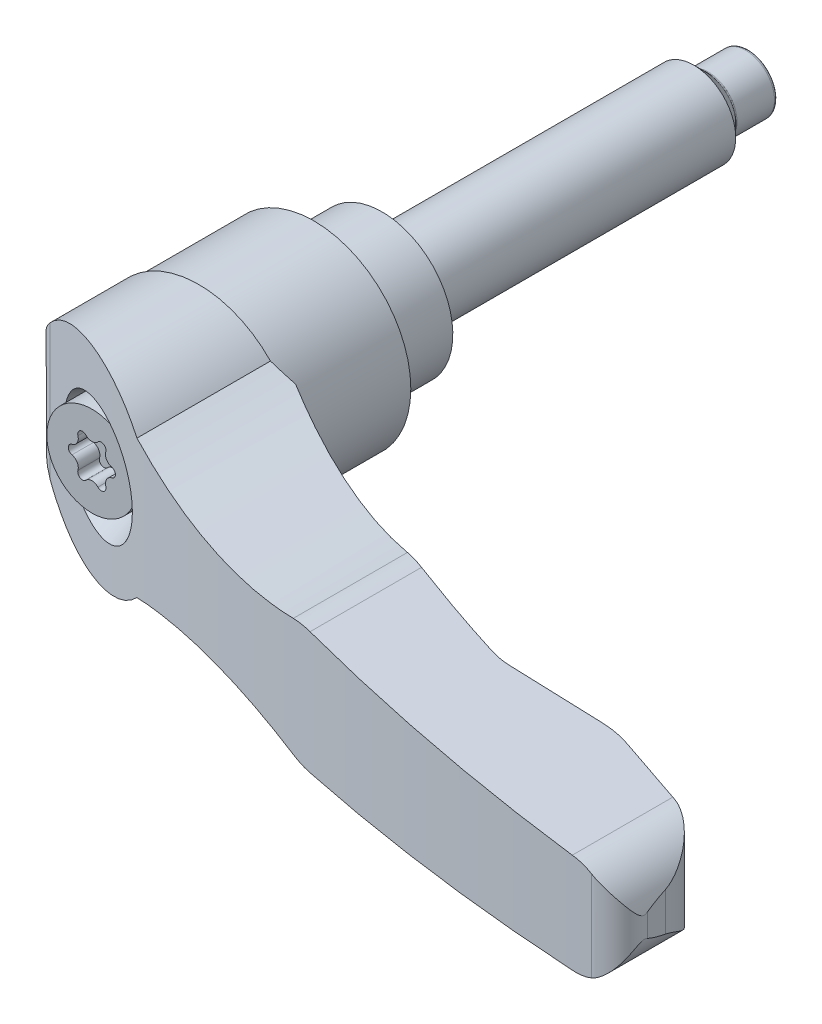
ISO-10303-21;
HEADER;
FILE_DESCRIPTION(('STEP AP214'),'2;1');
FILE_NAME('part.step','',(''),(''),'','','');
FILE_SCHEMA(('AUTOMOTIVE_DESIGN { 1 0 10303 214 1 1 1 1 }'));
ENDSEC;
DATA;
#1=APPLICATION_CONTEXT('core data for automotive mechanical design processes');
#2=APPLICATION_PROTOCOL_DEFINITION('international standard','automotive_design',2000,#1);
#3=PRODUCT_CONTEXT('',#1,'mechanical');
#4=PRODUCT('Part','Part','',(#3));
#5=PRODUCT_RELATED_PRODUCT_CATEGORY('part','',(#4));
#6=PRODUCT_DEFINITION_FORMATION('','',#4);
#7=PRODUCT_DEFINITION_CONTEXT('part definition',#1,'design');
#8=PRODUCT_DEFINITION('design','',#6,#7);
#9=PRODUCT_DEFINITION_SHAPE('','',#8);
#10=(LENGTH_UNIT() NAMED_UNIT(*) SI_UNIT(.MILLI.,.METRE.));
#11=(NAMED_UNIT(*) PLANE_ANGLE_UNIT() SI_UNIT($,.RADIAN.));
#12=(NAMED_UNIT(*) SI_UNIT($,.STERADIAN.) SOLID_ANGLE_UNIT());
#13=UNCERTAINTY_MEASURE_WITH_UNIT(LENGTH_MEASURE(1.E-05),#10,'distance_accuracy_value','');
#14=(GEOMETRIC_REPRESENTATION_CONTEXT(3) GLOBAL_UNCERTAINTY_ASSIGNED_CONTEXT((#13)) GLOBAL_UNIT_ASSIGNED_CONTEXT((#10,
#11,#12)) REPRESENTATION_CONTEXT('',''));
#15=CARTESIAN_POINT('',(0.,0.,0.));
#16=DIRECTION('',(0.,0.,1.));
#17=DIRECTION('',(1.,0.,0.));
#18=AXIS2_PLACEMENT_3D('',#15,#16,#17);
#19=CARTESIAN_POINT('',(6.75,0.,0.));
#20=DIRECTION('',(0.,0.,-1.));
#21=DIRECTION('',(0.,1.,0.));
#22=AXIS2_PLACEMENT_3D('',#19,#20,#21);
#23=PLANE('',#22);
#24=CARTESIAN_POINT('',(0.,0.,0.));
#25=DIRECTION('',(0.,0.,-1.));
#26=DIRECTION('',(0.,1.,0.));
#27=AXIS2_PLACEMENT_3D('',#24,#25,#26);
#28=CIRCLE('',#27,4.);
#29=CARTESIAN_POINT('',(0.,4.,0.));
#30=VERTEX_POINT('',#29);
#31=EDGE_CURVE('E9',#30,#30,#28,.T.);
#32=ORIENTED_EDGE('',*,*,#31,.F.);
#33=EDGE_LOOP('',(#32));
#34=FACE_BOUND('',#33,.T.);
#35=CARTESIAN_POINT('',(0.,0.,0.));
#36=DIRECTION('',(0.,0.,1.));
#37=DIRECTION('',(0.,-1.,0.));
#38=AXIS2_PLACEMENT_3D('',#35,#36,#37);
#39=CIRCLE('',#38,6.75);
#40=CARTESIAN_POINT('',(0.,-6.75,0.));
#41=VERTEX_POINT('',#40);
#42=EDGE_CURVE('E759',#41,#41,#39,.T.);
#43=ORIENTED_EDGE('',*,*,#42,.F.);
#44=EDGE_LOOP('',(#43));
#45=FACE_BOUND('',#44,.T.);
#46=ADVANCED_FACE('F14',(#34,#45),#23,.T.);
#47=CARTESIAN_POINT('',(0.,0.,6.5));
#48=DIRECTION('',(0.,0.,1.));
#49=DIRECTION('',(0.,-1.,0.));
#50=AXIS2_PLACEMENT_3D('',#47,#48,#49);
#51=CYLINDRICAL_SURFACE('',#50,6.75);
#52=CARTESIAN_POINT('',(0.,0.,6.5));
#53=DIRECTION('',(0.,0.,-1.));
#54=DIRECTION('',(1.,0.,0.));
#55=AXIS2_PLACEMENT_3D('',#52,#53,#54);
#56=CIRCLE('',#55,6.75);
#57=CARTESIAN_POINT('',(6.75,0.,6.5));
#58=VERTEX_POINT('',#57);
#59=EDGE_CURVE('E281',#58,#58,#56,.F.);
#60=ORIENTED_EDGE('',*,*,#59,.F.);
#61=EDGE_LOOP('',(#60));
#62=FACE_BOUND('',#61,.T.);
#63=ORIENTED_EDGE('',*,*,#42,.T.);
#64=EDGE_LOOP('',(#63));
#65=FACE_BOUND('',#64,.T.);
#66=ADVANCED_FACE('F541',(#62,#65),#51,.T.);
#67=CARTESIAN_POINT('',(42.239481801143,-10.5,23.0800000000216));
#68=DIRECTION('',(0.,1.,0.));
#69=DIRECTION('',(-1.,0.,0.));
#70=AXIS2_PLACEMENT_3D('',#67,#68,#69);
#71=CYLINDRICAL_SURFACE('',#70,6.97999999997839);
#72=CARTESIAN_POINT('',(42.239481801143,5.40097293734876,23.0800000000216));
#73=DIRECTION('',(0.036120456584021,0.999347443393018,0.));
#74=DIRECTION('',(-0.999347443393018,0.036120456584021,0.));
#75=AXIS2_PLACEMENT_3D('',#72,#73,#74);
#76=ELLIPSE('',#75,6.98455781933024,6.97999999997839);
#77=CARTESIAN_POINT('',(42.239481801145,5.4009729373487,30.06));
#78=VERTEX_POINT('',#77);
#79=CARTESIAN_POINT('',(40.302460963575,5.47098470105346,29.785844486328));
#80=VERTEX_POINT('',#79);
#81=EDGE_CURVE('E1393',#78,#80,#76,.F.);
#82=ORIENTED_EDGE('',*,*,#81,.F.);
#83=DIRECTION('',(0.,1.,0.));
#84=VECTOR('',#83,1.);
#85=CARTESIAN_POINT('',(42.239481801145,-10.5,30.06));
#86=LINE('',#85,#84);
#87=CARTESIAN_POINT('',(42.239481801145,-5.40097293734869,30.06));
#88=VERTEX_POINT('',#87);
#89=EDGE_CURVE('E660',#88,#78,#86,.T.);
#90=ORIENTED_EDGE('',*,*,#89,.F.);
#91=CARTESIAN_POINT('',(42.239481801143,-5.40097293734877,23.0800000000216));
#92=DIRECTION('',(0.036120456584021,-0.999347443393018,0.));
#93=DIRECTION('',(0.999347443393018,0.036120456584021,0.));
#94=AXIS2_PLACEMENT_3D('',#91,#92,#93);
#95=ELLIPSE('',#94,6.98455781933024,6.97999999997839);
#96=CARTESIAN_POINT('',(40.302460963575,-5.47098470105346,29.785844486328));
#97=VERTEX_POINT('',#96);
#98=EDGE_CURVE('E1398',#97,#88,#95,.F.);
#99=ORIENTED_EDGE('',*,*,#98,.F.);
#100=DIRECTION('',(0.,1.,0.));
#101=VECTOR('',#100,1.);
#102=CARTESIAN_POINT('',(40.302460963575,-10.5,29.785844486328));
#103=LINE('',#102,#101);
#104=EDGE_CURVE('E663',#97,#80,#103,.T.);
#105=ORIENTED_EDGE('',*,*,#104,.T.);
#106=EDGE_LOOP('',(#82,#90,#99,#105));
#107=FACE_BOUND('',#106,.T.);
#108=ADVANCED_FACE('F417',(#107),#71,.F.);
#109=CARTESIAN_POINT('',(42.239481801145,-10.5,30.06));
#110=DIRECTION('',(0.,0.,1.));
#111=DIRECTION('',(0.,-1.,0.));
#112=AXIS2_PLACEMENT_3D('',#109,#110,#111);
#113=PLANE('',#112);
#114=DIRECTION('',(-0.999347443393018,0.036120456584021,0.));
#115=VECTOR('',#114,1.);
#116=CARTESIAN_POINT('',(42.8134574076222,5.3802271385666,30.06));
#117=LINE('',#116,#115);
#118=CARTESIAN_POINT('',(51.078035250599,5.08151188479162,30.06));
#119=VERTEX_POINT('',#118);
#120=EDGE_CURVE('E1390',#119,#78,#117,.T.);
#121=ORIENTED_EDGE('',*,*,#120,.F.);
#122=DIRECTION('',(0.,1.,0.));
#123=VECTOR('',#122,1.);
#124=CARTESIAN_POINT('',(51.078035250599,-10.5,30.06));
#125=LINE('',#124,#123);
#126=CARTESIAN_POINT('',(51.078035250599,-5.08151188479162,30.06));
#127=VERTEX_POINT('',#126);
#128=EDGE_CURVE('E657',#127,#119,#125,.T.);
#129=ORIENTED_EDGE('',*,*,#128,.F.);
#130=DIRECTION('',(0.999347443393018,0.036120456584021,0.));
#131=VECTOR('',#130,1.);
#132=CARTESIAN_POINT('',(42.0554228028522,-5.40762557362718,30.06));
#133=LINE('',#132,#131);
#134=EDGE_CURVE('E1401',#88,#127,#133,.T.);
#135=ORIENTED_EDGE('',*,*,#134,.F.);
#136=ORIENTED_EDGE('',*,*,#89,.T.);
#137=EDGE_LOOP('',(#121,#129,#135,#136));
#138=FACE_BOUND('',#137,.T.);
#139=ADVANCED_FACE('F532',(#138),#113,.F.);
#140=CARTESIAN_POINT('',(51.0780352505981,-10.5,39.2200000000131));
#141=DIRECTION('',(0.,1.,0.));
#142=DIRECTION('',(-1.,0.,0.));
#143=AXIS2_PLACEMENT_3D('',#140,#141,#142);
#144=CYLINDRICAL_SURFACE('',#143,9.16000000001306);
#145=CARTESIAN_POINT('',(51.0780352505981,5.08151188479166,39.2200000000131));
#146=DIRECTION('',(0.036120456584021,0.999347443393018,0.));
#147=DIRECTION('',(-0.999347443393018,0.036120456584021,0.));
#148=AXIS2_PLACEMENT_3D('',#145,#146,#147);
#149=ELLIPSE('',#148,9.165981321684,9.16000000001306);
#150=CARTESIAN_POINT('',(53.829450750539,4.98206460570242,30.482991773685));
#151=VERTEX_POINT('',#150);
#152=EDGE_CURVE('E1389',#151,#119,#149,.T.);
#153=ORIENTED_EDGE('',*,*,#152,.F.);
#154=DIRECTION('',(0.,1.,0.));
#155=VECTOR('',#154,1.);
#156=CARTESIAN_POINT('',(53.829450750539,-10.5,30.482991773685));
#157=LINE('',#156,#155);
#158=CARTESIAN_POINT('',(53.829450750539,-4.98206460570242,30.482991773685));
#159=VERTEX_POINT('',#158);
#160=EDGE_CURVE('E654',#159,#151,#157,.T.);
#161=ORIENTED_EDGE('',*,*,#160,.F.);
#162=CARTESIAN_POINT('',(51.0780352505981,-5.08151188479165,39.2200000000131));
#163=DIRECTION('',(0.036120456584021,-0.999347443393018,0.));
#164=DIRECTION('',(0.999347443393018,0.036120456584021,0.));
#165=AXIS2_PLACEMENT_3D('',#162,#163,#164);
#166=ELLIPSE('',#165,9.165981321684,9.16000000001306);
#167=EDGE_CURVE('E1403',#127,#159,#166,.T.);
#168=ORIENTED_EDGE('',*,*,#167,.F.);
#169=ORIENTED_EDGE('',*,*,#128,.T.);
#170=EDGE_LOOP('',(#153,#161,#168,#169));
#171=FACE_BOUND('',#170,.T.);
#172=ADVANCED_FACE('F525',(#171),#144,.T.);
#173=CARTESIAN_POINT('',(58.6337202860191,-10.5,38.3283479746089));
#174=DIRECTION('',(0.,1.,0.));
#175=DIRECTION('',(-1.,0.,0.));
#176=AXIS2_PLACEMENT_3D('',#173,#174,#175);
#177=CYLINDRICAL_SURFACE('',#176,6.04000000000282);
#178=CARTESIAN_POINT('',(60.447972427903,-4.74587261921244,32.567263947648));
#179=CARTESIAN_POINT('',(60.5755504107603,-4.74057354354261,32.6074069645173));
#180=CARTESIAN_POINT('',(60.7015088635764,-4.73014540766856,32.6517620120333));
#181=CARTESIAN_POINT('',(60.9490652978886,-4.69992242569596,32.7481786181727));
#182=CARTESIAN_POINT('',(61.0706698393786,-4.68014236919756,32.8002279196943));
#183=CARTESIAN_POINT('',(61.3074659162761,-4.63235500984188,32.9108206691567));
#184=CARTESIAN_POINT('',(61.4227141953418,-4.6044427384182,32.9692844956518));
#185=CARTESIAN_POINT('',(61.647717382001,-4.54120548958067,33.0925213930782));
#186=CARTESIAN_POINT('',(61.7574696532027,-4.50587699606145,33.1572974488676));
#187=CARTESIAN_POINT('',(61.9940137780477,-4.42040174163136,33.3070323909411));
#188=CARTESIAN_POINT('',(62.119393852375,-4.36870213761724,33.3933358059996));
#189=CARTESIAN_POINT('',(62.3610721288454,-4.25718277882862,33.5732278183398));
#190=CARTESIAN_POINT('',(62.4773638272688,-4.19735729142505,33.666821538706));
#191=CARTESIAN_POINT('',(62.7012840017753,-4.07066877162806,33.8608437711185));
#192=CARTESIAN_POINT('',(62.8088611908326,-4.00376876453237,33.9613071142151));
#193=CARTESIAN_POINT('',(63.0146476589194,-3.86453813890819,34.1677809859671));
#194=CARTESIAN_POINT('',(63.1128596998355,-3.79220913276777,34.2737898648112));
#195=CARTESIAN_POINT('',(63.3331746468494,-3.61700510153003,34.5290929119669));
#196=CARTESIAN_POINT('',(63.4514763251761,-3.51235864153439,34.6804594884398));
#197=CARTESIAN_POINT('',(63.6718053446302,-3.29808480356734,34.9913387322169));
#198=CARTESIAN_POINT('',(63.7738256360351,-3.18845529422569,35.1508548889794));
#199=CARTESIAN_POINT('',(63.9616621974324,-2.96765680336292,35.4770445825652));
#200=CARTESIAN_POINT('',(64.047537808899,-2.85649513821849,35.6436890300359));
#201=CARTESIAN_POINT('',(64.2038484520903,-2.63586419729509,35.9851508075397));
#202=CARTESIAN_POINT('',(64.2742871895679,-2.52639452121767,36.1599661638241));
#203=CARTESIAN_POINT('',(64.3705847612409,-2.36382517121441,36.4361542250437));
#204=CARTESIAN_POINT('',(64.4019853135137,-2.30809068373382,36.5340606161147));
#205=CARTESIAN_POINT('',(64.4601539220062,-2.20019362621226,36.7330390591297));
#206=CARTESIAN_POINT('',(64.4869269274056,-2.14802727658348,36.8341075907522));
#207=CARTESIAN_POINT('',(64.5357331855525,-2.04890785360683,37.0402846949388));
#208=CARTESIAN_POINT('',(64.5577546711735,-2.00196785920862,37.1454025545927));
#209=CARTESIAN_POINT('',(64.5966140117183,-1.91618262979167,37.360168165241));
#210=CARTESIAN_POINT('',(64.6134353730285,-1.87736327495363,37.4698291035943));
#211=CARTESIAN_POINT('',(64.62740519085,-1.84413226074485,37.581795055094));
#212=B_SPLINE_CURVE_WITH_KNOTS('',3,(#178,#179,#180,#181,#182,#183,#184,#185,#186,#187,#188,
#189,#190,#191,#192,#193,#194,#195,#196,#197,#198,#199,#200,#201,#202,#203,#204,#205,#206,#207,
#208,#209,#210,#211),.UNSPECIFIED.,.F.,.F.,(4,2,2,2,2,2,2,2,2,2,2,2,2,2,2,2,4),(0.,
0.401264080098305,0.801895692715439,1.19802151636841,1.5943355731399,2.07588331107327,
2.55777255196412,3.04231807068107,3.5267202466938,4.18208013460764,4.83772302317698,
5.4909067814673,6.14393356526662,6.49464389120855,6.84497677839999,7.19616755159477,
7.54846105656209),.UNSPECIFIED.);
#213=CARTESIAN_POINT('',(60.447972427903,-4.74587261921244,32.567263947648));
#214=VERTEX_POINT('',#213);
#215=CARTESIAN_POINT('',(64.62740519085,-1.84413226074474,37.581795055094));
#216=VERTEX_POINT('',#215);
#217=EDGE_CURVE('E507',#214,#216,#212,.T.);
#218=ORIENTED_EDGE('',*,*,#217,.F.);
#219=DIRECTION('',(0.,1.,0.));
#220=VECTOR('',#219,1.);
#221=CARTESIAN_POINT('',(60.447972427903,-10.5,32.567263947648));
#222=LINE('',#221,#220);
#223=CARTESIAN_POINT('',(60.447972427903,4.74587261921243,32.567263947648));
#224=VERTEX_POINT('',#223);
#225=EDGE_CURVE('E651',#214,#224,#222,.T.);
#226=ORIENTED_EDGE('',*,*,#225,.T.);
#227=CARTESIAN_POINT('',(64.62740519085,1.84413226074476,37.581795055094));
#228=CARTESIAN_POINT('',(64.617586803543,1.86745330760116,37.5030045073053));
#229=CARTESIAN_POINT('',(64.6063375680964,1.89362327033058,37.4253204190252));
#230=CARTESIAN_POINT('',(64.5811702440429,1.95049016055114,37.2721928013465));
#231=CARTESIAN_POINT('',(64.5672561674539,1.98118026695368,37.1967460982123));
#232=CARTESIAN_POINT('',(64.5369883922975,2.0458503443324,37.0482136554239));
#233=CARTESIAN_POINT('',(64.520645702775,2.07981523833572,36.9751189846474));
#234=CARTESIAN_POINT('',(64.4855821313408,2.15032519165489,36.830739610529));
#235=CARTESIAN_POINT('',(64.4668602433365,2.18687133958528,36.75945568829));
#236=CARTESIAN_POINT('',(64.4072221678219,2.29938724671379,36.5479610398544));
#237=CARTESIAN_POINT('',(64.3628565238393,2.37818379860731,36.4102182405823));
#238=CARTESIAN_POINT('',(64.2652007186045,2.53960895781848,36.1400450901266));
#239=CARTESIAN_POINT('',(64.2118976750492,2.62224297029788,36.0076227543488));
#240=CARTESIAN_POINT('',(64.0771192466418,2.81672317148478,35.7040219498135));
#241=CARTESIAN_POINT('',(63.9921849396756,2.92909268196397,35.5347005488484));
#242=CARTESIAN_POINT('',(63.8063278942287,3.15216626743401,35.2039790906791));
#243=CARTESIAN_POINT('',(63.7054078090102,3.26287061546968,35.0425777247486));
#244=CARTESIAN_POINT('',(63.4870671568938,3.47959027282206,34.7278934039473));
#245=CARTESIAN_POINT('',(63.3696459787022,3.58560540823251,34.5746107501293));
#246=CARTESIAN_POINT('',(63.1179209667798,3.78996521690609,34.2772360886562));
#247=CARTESIAN_POINT('',(62.9836257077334,3.88831374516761,34.1331394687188));
#248=CARTESIAN_POINT('',(62.6561598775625,4.10136712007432,33.8153134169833));
#249=CARTESIAN_POINT('',(62.457188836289,4.21258905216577,33.6450495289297));
#250=CARTESIAN_POINT('',(62.1378586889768,4.36029911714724,33.406945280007));
#251=CARTESIAN_POINT('',(62.0281124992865,4.40629516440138,33.3305585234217));
#252=CARTESIAN_POINT('',(61.8018114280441,4.49098569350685,33.1841350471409));
#253=CARTESIAN_POINT('',(61.6852609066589,4.5296847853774,33.1140943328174));
#254=CARTESIAN_POINT('',(61.4786111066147,4.58924867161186,32.9993621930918));
#255=CARTESIAN_POINT('',(61.3900115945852,4.61209493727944,32.9529824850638));
#256=CARTESIAN_POINT('',(61.2097340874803,4.65295056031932,32.864298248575));
#257=CARTESIAN_POINT('',(61.1180570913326,4.67096147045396,32.8219924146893));
#258=CARTESIAN_POINT('',(60.9313596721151,4.70183469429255,32.7415027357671));
#259=CARTESIAN_POINT('',(60.8363219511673,4.71466416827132,32.7033462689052));
#260=CARTESIAN_POINT('',(60.643828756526,4.73463763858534,32.6317122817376));
#261=CARTESIAN_POINT('',(60.5463713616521,4.74177695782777,32.5982386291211));
#262=CARTESIAN_POINT('',(60.447972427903,4.74587261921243,32.567263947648));
#263=B_SPLINE_CURVE_WITH_KNOTS('',3,(#227,#228,#229,#230,#231,#232,#233,#234,#235,#236,#237,
#238,#239,#240,#241,#242,#243,#244,#245,#246,#247,#248,#249,#250,#251,#252,#253,#254,#255,#256,
#257,#258,#259,#260,#261,#262),.UNSPECIFIED.,.F.,.F.,(4,2,2,2,2,2,2,2,2,2,2,2,2,2,2,2,2,4),(0.,
0.248076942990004,0.495783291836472,0.742399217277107,0.989119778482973,1.48293160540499,
1.97746142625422,2.63745339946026,3.29733594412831,3.95724294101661,4.61681594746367,
5.4669358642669,5.8907548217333,6.31430511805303,6.62183365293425,6.92926331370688,
7.23861197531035,7.54821464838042),.UNSPECIFIED.);
#264=CARTESIAN_POINT('',(64.62740519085,1.84413226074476,37.581795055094));
#265=VERTEX_POINT('',#264);
#266=EDGE_CURVE('E492',#265,#224,#263,.T.);
#267=ORIENTED_EDGE('',*,*,#266,.F.);
#268=DIRECTION('',(0.,1.,0.));
#269=VECTOR('',#268,1.);
#270=CARTESIAN_POINT('',(64.62740519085,-10.5,37.581795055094));
#271=LINE('',#270,#269);
#272=EDGE_CURVE('E648',#216,#265,#271,.T.);
#273=ORIENTED_EDGE('',*,*,#272,.F.);
#274=EDGE_LOOP('',(#218,#226,#267,#273));
#275=FACE_BOUND('',#274,.T.);
#276=ADVANCED_FACE('F520',(#275),#177,.T.);
#277=CARTESIAN_POINT('',(64.62740519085,-10.5,37.581795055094));
#278=DIRECTION('',(-0.992331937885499,0.,0.123601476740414));
#279=DIRECTION('',(-0.123601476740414,0.,-0.992331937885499));
#280=AXIS2_PLACEMENT_3D('',#277,#278,#279);
#281=PLANE('',#280);
#282=CARTESIAN_POINT('',(60.25,0.,2.43788666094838));
#283=DIRECTION('',(-0.992331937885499,0.,0.123601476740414));
#284=DIRECTION('',(0.123601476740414,0.,0.992331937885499));
#285=AXIS2_PLACEMENT_3D('',#282,#283,#284);
#286=ELLIPSE('',#285,38.429961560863,4.75);
#287=CARTESIAN_POINT('',(64.874540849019,1.08449155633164,39.565918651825));
#288=VERTEX_POINT('',#287);
#289=EDGE_CURVE('E1413',#288,#265,#286,.T.);
#290=ORIENTED_EDGE('',*,*,#289,.F.);
#291=DIRECTION('',(0.,1.,0.));
#292=VECTOR('',#291,1.);
#293=CARTESIAN_POINT('',(64.874540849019,-10.5,39.565918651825));
#294=LINE('',#293,#292);
#295=CARTESIAN_POINT('',(64.874540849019,-1.08449155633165,39.565918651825));
#296=VERTEX_POINT('',#295);
#297=EDGE_CURVE('E645',#296,#288,#294,.T.);
#298=ORIENTED_EDGE('',*,*,#297,.F.);
#299=EDGE_CURVE('E505',#216,#296,#286,.T.);
#300=ORIENTED_EDGE('',*,*,#299,.F.);
#301=ORIENTED_EDGE('',*,*,#272,.T.);
#302=EDGE_LOOP('',(#290,#298,#300,#301));
#303=FACE_BOUND('',#302,.T.);
#304=ADVANCED_FACE('F517',(#303),#281,.F.);
#305=CARTESIAN_POINT('',(53.829450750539,-10.5,30.482991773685));
#306=DIRECTION('',(-0.300372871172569,0.,0.95382185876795));
#307=DIRECTION('',(-0.95382185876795,0.,-0.300372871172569));
#308=AXIS2_PLACEMENT_3D('',#305,#306,#307);
#309=PLANE('',#308);
#310=DIRECTION('',(-0.953255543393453,0.0344545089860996,-0.300194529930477));
#311=VECTOR('',#310,1.);
#312=CARTESIAN_POINT('',(54.3379429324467,4.96368564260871,30.6431236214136));
#313=LINE('',#312,#311);
#314=CARTESIAN_POINT('',(60.25,4.75,32.5049194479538));
#315=VERTEX_POINT('',#314);
#316=EDGE_CURVE('E1385',#315,#151,#313,.T.);
#317=ORIENTED_EDGE('',*,*,#316,.F.);
#318=CARTESIAN_POINT('',(60.25,0.,32.5049194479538));
#319=DIRECTION('',(-0.300372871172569,0.,0.95382185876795));
#320=DIRECTION('',(0.95382185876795,0.,0.300372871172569));
#321=AXIS2_PLACEMENT_3D('',#318,#319,#320);
#322=ELLIPSE('',#321,4.97996555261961,4.75);
#323=EDGE_CURVE('E506',#224,#315,#322,.T.);
#324=ORIENTED_EDGE('',*,*,#323,.F.);
#325=ORIENTED_EDGE('',*,*,#225,.F.);
#326=CARTESIAN_POINT('',(60.25,-4.75,32.5049194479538));
#327=VERTEX_POINT('',#326);
#328=EDGE_CURVE('E1384',#327,#214,#322,.T.);
#329=ORIENTED_EDGE('',*,*,#328,.F.);
#330=DIRECTION('',(0.953255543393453,0.0344545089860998,0.300194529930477));
#331=VECTOR('',#330,1.);
#332=CARTESIAN_POINT('',(53.6482199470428,-4.98861501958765,30.4259194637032));
#333=LINE('',#332,#331);
#334=EDGE_CURVE('E438',#159,#327,#333,.T.);
#335=ORIENTED_EDGE('',*,*,#334,.F.);
#336=ORIENTED_EDGE('',*,*,#160,.T.);
#337=EDGE_LOOP('',(#317,#324,#325,#329,#335,#336));
#338=FACE_BOUND('',#337,.T.);
#339=ADVANCED_FACE('F415',(#338),#309,.F.);
#340=CARTESIAN_POINT('',(88.9416647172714,-10.5,-138.600024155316));
#341=DIRECTION('',(0.,1.,0.));
#342=DIRECTION('',(-1.,0.,0.));
#343=AXIS2_PLACEMENT_3D('',#340,#341,#342);
#344=CYLINDRICAL_SURFACE('',#343,175.269999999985);
#345=CARTESIAN_POINT('',(28.237973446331,-5.6261685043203,25.8220995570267));
#346=CARTESIAN_POINT('',(28.4107669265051,-5.66655022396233,25.8858955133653));
#347=CARTESIAN_POINT('',(28.5848476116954,-5.70116065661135,25.9498539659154));
#348=CARTESIAN_POINT('',(28.9342210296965,-5.75862584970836,26.0775818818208));
#349=CARTESIAN_POINT('',(29.1095064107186,-5.78152582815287,26.1413511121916));
#350=CARTESIAN_POINT('',(29.4612825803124,-5.81567270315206,26.2686873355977));
#351=CARTESIAN_POINT('',(29.6377733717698,-5.82691957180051,26.3322543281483));
#352=CARTESIAN_POINT('',(29.9919650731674,-5.83772087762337,26.4591818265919));
#353=CARTESIAN_POINT('',(30.1696680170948,-5.83722946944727,26.5225405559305));
#354=CARTESIAN_POINT('',(30.347286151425,-5.8308049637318,26.5855433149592));
#355=B_SPLINE_CURVE_WITH_KNOTS('',3,(#345,#346,#347,#348,#349,#350,#351,#352,#353,#354),
.UNSPECIFIED.,.F.,.F.,(4,2,2,2,4),(0.,0.565611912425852,1.12902299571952,1.692435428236,
2.25804869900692),.UNSPECIFIED.);
#356=CARTESIAN_POINT('',(28.237973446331,-5.6261685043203,25.8220995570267));
#357=VERTEX_POINT('',#356);
#358=CARTESIAN_POINT('',(30.347286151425,-5.8308049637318,26.5855433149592));
#359=VERTEX_POINT('',#358);
#360=EDGE_CURVE('E432',#357,#359,#355,.T.);
#361=ORIENTED_EDGE('',*,*,#360,.F.);
#362=CARTESIAN_POINT('',(9.24,-5.87940068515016,17.5));
#363=CARTESIAN_POINT('',(9.7994800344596,-5.73283344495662,17.7856672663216));
#364=CARTESIAN_POINT('',(10.3630165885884,-5.59833643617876,18.0695987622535));
#365=CARTESIAN_POINT('',(11.4974282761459,-5.35391463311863,18.633444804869));
#366=CARTESIAN_POINT('',(12.0683039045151,-5.24399150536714,18.9133590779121));
#367=CARTESIAN_POINT('',(13.2171050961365,-5.04907387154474,19.4688580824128));
#368=CARTESIAN_POINT('',(13.7950370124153,-4.9641038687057,19.7444383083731));
#369=CARTESIAN_POINT('',(14.9564491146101,-4.81968144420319,20.2904183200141));
#370=CARTESIAN_POINT('',(15.5399291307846,-4.7602282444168,20.5608182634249));
#371=CARTESIAN_POINT('',(17.274544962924,-4.62260622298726,21.3530632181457));
#372=CARTESIAN_POINT('',(18.4324989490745,-4.58133087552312,21.8669029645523));
#373=CARTESIAN_POINT('',(20.7578250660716,-4.6016852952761,22.8686662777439));
#374=CARTESIAN_POINT('',(21.9251896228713,-4.66323920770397,23.3566086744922));
#375=CARTESIAN_POINT('',(23.5210667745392,-4.81923174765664,24.0035807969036));
#376=CARTESIAN_POINT('',(23.9492706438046,-4.86815262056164,24.1752006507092));
#377=CARTESIAN_POINT('',(24.8053598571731,-4.98022826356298,24.5144113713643));
#378=CARTESIAN_POINT('',(25.2332452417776,-5.04338071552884,24.6820028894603));
#379=CARTESIAN_POINT('',(26.0913487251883,-5.18451989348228,25.0142291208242));
#380=CARTESIAN_POINT('',(26.5215613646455,-5.26261041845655,25.1788337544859));
#381=CARTESIAN_POINT('',(27.3808012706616,-5.43340913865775,25.5037363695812));
#382=CARTESIAN_POINT('',(27.8098283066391,-5.52611999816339,25.6640335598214));
#383=CARTESIAN_POINT('',(28.237973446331,-5.62616850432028,25.8220995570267));
#384=B_SPLINE_CURVE_WITH_KNOTS('',3,(#362,#363,#364,#365,#366,#367,#368,#369,#370,#371,#372,
#373,#374,#375,#376,#377,#378,#379,#380,#381,#382,#383),.UNSPECIFIED.,.F.,.F.,(4,2,2,2,2,2,2,2,
2,2,4),(0.,1.93506781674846,3.87026682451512,5.80735983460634,7.74439376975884,11.5423680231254,
15.337541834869,16.7290778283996,18.120387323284,19.5217408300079,20.9233500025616),.UNSPECIFIED.);
#385=CARTESIAN_POINT('',(9.24,-5.87940068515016,17.5));
#386=VERTEX_POINT('',#385);
#387=EDGE_CURVE('E423',#386,#357,#384,.T.);
#388=ORIENTED_EDGE('',*,*,#387,.F.);
#389=DIRECTION('',(0.,1.,0.));
#390=VECTOR('',#389,1.);
#391=CARTESIAN_POINT('',(9.24,-10.5,17.5));
#392=LINE('',#391,#390);
#393=CARTESIAN_POINT('',(9.24,0.,17.5));
#394=VERTEX_POINT('',#393);
#395=EDGE_CURVE('E667',#386,#394,#392,.T.);
#396=ORIENTED_EDGE('',*,*,#395,.T.);
#397=CARTESIAN_POINT('',(9.24,5.87940068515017,17.5));
#398=VERTEX_POINT('',#397);
#399=EDGE_CURVE('E666',#394,#398,#392,.T.);
#400=ORIENTED_EDGE('',*,*,#399,.T.);
#401=CARTESIAN_POINT('',(28.237973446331,5.62616850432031,25.8220995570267));
#402=CARTESIAN_POINT('',(27.6467124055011,5.48799745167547,25.6038196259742));
#403=CARTESIAN_POINT('',(27.053777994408,5.36383084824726,25.3812778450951));
#404=CARTESIAN_POINT('',(25.8659006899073,5.14331117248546,24.9280288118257));
#405=CARTESIAN_POINT('',(25.2709579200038,5.0469564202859,24.6973220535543));
#406=CARTESIAN_POINT('',(24.0803912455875,4.88185687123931,24.2280988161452));
#407=CARTESIAN_POINT('',(23.4847674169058,4.81310925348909,23.9895831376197));
#408=CARTESIAN_POINT('',(22.2940534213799,4.70292970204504,23.5051335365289));
#409=CARTESIAN_POINT('',(21.6989632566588,4.66149787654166,23.2591995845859));
#410=CARTESIAN_POINT('',(19.9382363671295,4.57874286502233,22.5201121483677));
#411=CARTESIAN_POINT('',(18.7748149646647,4.57591682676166,22.0168726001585));
#412=CARTESIAN_POINT('',(16.4631439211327,4.67145944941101,20.9870607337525));
#413=CARTESIAN_POINT('',(15.3148886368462,4.76978933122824,20.4604974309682));
#414=CARTESIAN_POINT('',(13.7610005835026,4.97097993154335,19.7276539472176));
#415=CARTESIAN_POINT('',(13.34559469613,5.03153416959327,19.5297267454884));
#416=CARTESIAN_POINT('',(12.5181281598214,5.16561835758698,19.1314774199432));
#417=CARTESIAN_POINT('',(12.1060667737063,5.23914536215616,18.9311558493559));
#418=CARTESIAN_POINT('',(11.2826997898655,5.39957122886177,18.5268986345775));
#419=CARTESIAN_POINT('',(10.8714191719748,5.48655913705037,18.3229475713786));
#420=CARTESIAN_POINT('',(10.052717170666,5.67338492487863,17.9129677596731));
#421=CARTESIAN_POINT('',(9.64529662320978,5.77322552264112,17.7069385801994));
#422=CARTESIAN_POINT('',(9.24,5.87940068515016,17.5));
#423=B_SPLINE_CURVE_WITH_KNOTS('',3,(#401,#402,#403,#404,#405,#406,#407,#408,#409,#410,#411,
#412,#413,#414,#415,#416,#417,#418,#419,#420,#421,#422),.UNSPECIFIED.,.F.,.F.,(4,2,2,2,2,2,2,2,
2,2,4),(0.,1.93549726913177,3.87087760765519,5.8060601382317,7.74125033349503,11.5393004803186,
15.3358951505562,16.7281050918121,18.1199993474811,19.5215293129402,20.9233561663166),.UNSPECIFIED.);
#424=CARTESIAN_POINT('',(28.237973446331,5.6261685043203,25.8220995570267));
#425=VERTEX_POINT('',#424);
#426=EDGE_CURVE('E403',#425,#398,#423,.T.);
#427=ORIENTED_EDGE('',*,*,#426,.F.);
#428=CARTESIAN_POINT('',(30.347286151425,5.8308049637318,26.5855433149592));
#429=CARTESIAN_POINT('',(30.1696680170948,5.83722946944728,26.5225405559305));
#430=CARTESIAN_POINT('',(29.9919650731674,5.83772087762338,26.4591818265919));
#431=CARTESIAN_POINT('',(29.6377733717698,5.82691957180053,26.3322543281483));
#432=CARTESIAN_POINT('',(29.4612825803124,5.81567270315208,26.2686873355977));
#433=CARTESIAN_POINT('',(29.1095064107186,5.78152582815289,26.1413511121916));
#434=CARTESIAN_POINT('',(28.9342210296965,5.75862584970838,26.0775818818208));
#435=CARTESIAN_POINT('',(28.5848476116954,5.70116065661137,25.9498539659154));
#436=CARTESIAN_POINT('',(28.4107669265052,5.66655022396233,25.8858955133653));
#437=CARTESIAN_POINT('',(28.237973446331,5.6261685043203,25.8220995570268));
#438=B_SPLINE_CURVE_WITH_KNOTS('',3,(#428,#429,#430,#431,#432,#433,#434,#435,#436,#437),
.UNSPECIFIED.,.F.,.F.,(4,2,2,2,4),(0.,0.56561327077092,1.12902570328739,1.69243678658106,
2.25804869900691),.UNSPECIFIED.);
#439=CARTESIAN_POINT('',(30.347286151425,5.8308049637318,26.5855433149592));
#440=VERTEX_POINT('',#439);
#441=EDGE_CURVE('E395',#440,#425,#438,.T.);
#442=ORIENTED_EDGE('',*,*,#441,.F.);
#443=CARTESIAN_POINT('',(88.9416647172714,3.71296724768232,-138.600024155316));
#444=DIRECTION('',(0.036120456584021,0.999347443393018,0.));
#445=DIRECTION('',(-0.999347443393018,0.036120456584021,0.));
#446=AXIS2_PLACEMENT_3D('',#443,#444,#445);
#447=ELLIPSE('',#446,175.384448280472,175.269999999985);
#448=EDGE_CURVE('E404',#80,#440,#447,.F.);
#449=ORIENTED_EDGE('',*,*,#448,.F.);
#450=ORIENTED_EDGE('',*,*,#104,.F.);
#451=CARTESIAN_POINT('',(88.9416647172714,-3.71296724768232,-138.600024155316));
#452=DIRECTION('',(0.036120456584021,-0.999347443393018,0.));
#453=DIRECTION('',(0.999347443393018,0.036120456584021,0.));
#454=AXIS2_PLACEMENT_3D('',#451,#452,#453);
#455=ELLIPSE('',#454,175.384448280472,175.269999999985);
#456=EDGE_CURVE('E1400',#359,#97,#455,.F.);
#457=ORIENTED_EDGE('',*,*,#456,.F.);
#458=EDGE_LOOP('',(#361,#388,#396,#400,#427,#442,#449,#450,#457));
#459=FACE_BOUND('',#458,.T.);
#460=ADVANCED_FACE('F411',(#459),#344,.F.);
#461=CARTESIAN_POINT('',(-9.26,-10.5,21.203824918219));
#462=DIRECTION('',(1.,0.,0.));
#463=DIRECTION('',(0.,1.,0.));
#464=AXIS2_PLACEMENT_3D('',#461,#462,#463);
#465=PLANE('',#464);
#466=DIRECTION('',(0.,0.,1.));
#467=VECTOR('',#466,1.);
#468=CARTESIAN_POINT('',(-9.26,2.12188595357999,0.));
#469=LINE('',#468,#467);
#470=CARTESIAN_POINT('',(-9.26,2.12188595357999,17.5));
#471=VERTEX_POINT('',#470);
#472=CARTESIAN_POINT('',(-9.26,2.12188595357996,21.203824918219));
#473=VERTEX_POINT('',#472);
#474=EDGE_CURVE('E320',#471,#473,#469,.T.);
#475=ORIENTED_EDGE('',*,*,#474,.F.);
#476=DIRECTION('',(0.,1.,0.));
#477=VECTOR('',#476,1.);
#478=CARTESIAN_POINT('',(-9.26,-10.5,17.5));
#479=LINE('',#478,#477);
#480=CARTESIAN_POINT('',(-9.26,0.,17.5));
#481=VERTEX_POINT('',#480);
#482=EDGE_CURVE('E668',#481,#471,#479,.T.);
#483=ORIENTED_EDGE('',*,*,#482,.F.);
#484=CARTESIAN_POINT('',(-9.26,-2.12188595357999,17.5));
#485=VERTEX_POINT('',#484);
#486=EDGE_CURVE('E669',#485,#481,#479,.T.);
#487=ORIENTED_EDGE('',*,*,#486,.F.);
#488=DIRECTION('',(0.,0.,1.));
#489=VECTOR('',#488,1.);
#490=CARTESIAN_POINT('',(-9.26,-2.12188595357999,0.));
#491=LINE('',#490,#489);
#492=CARTESIAN_POINT('',(-9.26,-2.12188595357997,21.203824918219));
#493=VERTEX_POINT('',#492);
#494=EDGE_CURVE('E690',#493,#485,#491,.F.);
#495=ORIENTED_EDGE('',*,*,#494,.F.);
#496=DIRECTION('',(0.,1.,0.));
#497=VECTOR('',#496,1.);
#498=CARTESIAN_POINT('',(-9.26,-10.5,21.203824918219));
#499=LINE('',#498,#497);
#500=EDGE_CURVE('E636',#493,#473,#499,.T.);
#501=ORIENTED_EDGE('',*,*,#500,.T.);
#502=EDGE_LOOP('',(#475,#483,#487,#495,#501));
#503=FACE_BOUND('',#502,.T.);
#504=ADVANCED_FACE('F16',(#503),#465,.F.);
#505=CARTESIAN_POINT('',(62.4730975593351,-10.5,39.8650342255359));
#506=DIRECTION('',(0.,1.,0.));
#507=DIRECTION('',(-1.,0.,0.));
#508=AXIS2_PLACEMENT_3D('',#505,#506,#507);
#509=CYLINDRICAL_SURFACE('',#508,2.42000000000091);
#510=CARTESIAN_POINT('',(64.874540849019,-1.08449155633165,39.565918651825));
#511=CARTESIAN_POINT('',(64.8785986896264,-1.06718866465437,39.5983671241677));
#512=CARTESIAN_POINT('',(64.8821274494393,-1.05169442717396,39.6321861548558));
#513=CARTESIAN_POINT('',(64.887857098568,-1.02613774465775,39.7020851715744));
#514=CARTESIAN_POINT('',(64.8900508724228,-1.01610443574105,39.7381761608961));
#515=CARTESIAN_POINT('',(64.8925173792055,-1.00476860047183,39.8044107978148));
#516=CARTESIAN_POINT('',(64.8930868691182,-1.00211989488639,39.8342978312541));
#517=CARTESIAN_POINT('',(64.893107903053,-1.00202247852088,39.8939346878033));
#518=CARTESIAN_POINT('',(64.8925646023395,-1.00454978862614,39.9236845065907));
#519=CARTESIAN_POINT('',(64.8901977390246,-1.01543140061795,39.988754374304));
#520=CARTESIAN_POINT('',(64.8881197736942,-1.02494097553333,40.0238668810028));
#521=CARTESIAN_POINT('',(64.8826618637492,-1.04933186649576,40.0921614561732));
#522=CARTESIAN_POINT('',(64.8792751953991,-1.06424089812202,40.1253325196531));
#523=CARTESIAN_POINT('',(64.8707967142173,-1.10051711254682,40.1949883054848));
#524=CARTESIAN_POINT('',(64.865514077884,-1.12254833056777,40.2310942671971));
#525=CARTESIAN_POINT('',(64.8537694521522,-1.16978917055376,40.3009885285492));
#526=CARTESIAN_POINT('',(64.8473052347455,-1.19500476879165,40.3347722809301));
#527=CARTESIAN_POINT('',(64.8263124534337,-1.27389295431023,40.4336855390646));
#528=CARTESIAN_POINT('',(64.8102295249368,-1.33060052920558,40.4960374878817));
#529=CARTESIAN_POINT('',(64.7786166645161,-1.43400674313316,40.6021014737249));
#530=CARTESIAN_POINT('',(64.7638216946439,-1.47998086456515,40.6467854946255));
#531=CARTESIAN_POINT('',(64.7321709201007,-1.57323332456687,40.7340230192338));
#532=CARTESIAN_POINT('',(64.7153150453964,-1.62051170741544,40.7765764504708));
#533=CARTESIAN_POINT('',(64.6616519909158,-1.7635753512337,40.9018121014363));
#534=CARTESIAN_POINT('',(64.6217887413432,-1.86045745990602,40.9819411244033));
#535=CARTESIAN_POINT('',(64.5338775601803,-2.05482553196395,41.1368408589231));
#536=CARTESIAN_POINT('',(64.4858262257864,-2.15231173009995,41.2116093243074));
#537=CARTESIAN_POINT('',(64.3813817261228,-2.34655824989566,41.3559330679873));
#538=CARTESIAN_POINT('',(64.3249946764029,-2.44331904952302,41.4254921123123));
#539=CARTESIAN_POINT('',(64.2010440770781,-2.63927132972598,41.5619270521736));
#540=CARTESIAN_POINT('',(64.1331103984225,-2.73839405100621,41.6285673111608));
#541=CARTESIAN_POINT('',(63.9875502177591,-2.9339539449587,41.7550430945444));
#542=CARTESIAN_POINT('',(63.9099192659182,-3.03038985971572,41.8148754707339));
#543=CARTESIAN_POINT('',(63.7450090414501,-3.21917021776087,41.9262233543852));
#544=CARTESIAN_POINT('',(63.6577618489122,-3.31152690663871,41.9777651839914));
#545=CARTESIAN_POINT('',(63.4734923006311,-3.49115406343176,42.0709971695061));
#546=CARTESIAN_POINT('',(63.3764795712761,-3.57842940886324,42.1126968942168));
#547=CARTESIAN_POINT('',(63.1547455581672,-3.76151883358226,42.1905140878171));
#548=CARTESIAN_POINT('',(63.0281574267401,-3.85611591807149,42.2243424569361));
#549=CARTESIAN_POINT('',(62.8299301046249,-3.9890861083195,42.2595211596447));
#550=CARTESIAN_POINT('',(62.7625442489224,-4.03187863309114,42.2686518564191));
#551=CARTESIAN_POINT('',(62.6253156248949,-4.11421404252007,42.2812228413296));
#552=CARTESIAN_POINT('',(62.5554745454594,-4.15375910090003,42.2846669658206));
#553=CARTESIAN_POINT('',(62.4501277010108,-4.20992585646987,42.2851722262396));
#554=CARTESIAN_POINT('',(62.4153463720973,-4.22791984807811,42.2845982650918));
#555=CARTESIAN_POINT('',(62.3453991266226,-4.26301931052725,42.2819160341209));
#556=CARTESIAN_POINT('',(62.3102332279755,-4.28012482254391,42.2798078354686));
#557=CARTESIAN_POINT('',(62.274907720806,-4.29677189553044,42.276905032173));
#558=B_SPLINE_CURVE_WITH_KNOTS('',3,(#510,#511,#512,#513,#514,#515,#516,#517,#518,#519,#520,
#521,#522,#523,#524,#525,#526,#527,#528,#529,#530,#531,#532,#533,#534,#535,#536,#537,#538,#539,
#540,#541,#542,#543,#544,#545,#546,#547,#548,#549,#550,#551,#552,#553,#554,#555,#556,#557),
.UNSPECIFIED.,.F.,.F.,(4,2,2,2,2,2,2,2,2,2,2,2,2,2,2,2,2,2,2,2,2,2,2,4),(0.,0.111397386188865,
0.223383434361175,0.312940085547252,0.40208278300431,0.510754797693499,0.619992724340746,
0.74757195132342,0.875394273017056,1.13222687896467,1.32956324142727,1.52690631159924,
1.92215497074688,2.31756828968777,2.71269293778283,3.12442404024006,3.53634477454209,
3.94693069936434,4.35711578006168,4.83979528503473,5.08059190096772,5.32122600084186,
5.43868329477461,5.55613514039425),.UNSPECIFIED.);
#559=CARTESIAN_POINT('',(62.274907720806,-4.29677189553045,42.2769050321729));
#560=VERTEX_POINT('',#559);
#561=EDGE_CURVE('E500',#296,#560,#558,.T.);
#562=ORIENTED_EDGE('',*,*,#561,.F.);
#563=ORIENTED_EDGE('',*,*,#297,.T.);
#564=CARTESIAN_POINT('',(62.274907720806,4.29677189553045,42.276905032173));
#565=CARTESIAN_POINT('',(62.3484429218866,4.26213869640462,42.2829554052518));
#566=CARTESIAN_POINT('',(62.4212610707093,4.22549552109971,42.2855470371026));
#567=CARTESIAN_POINT('',(62.564774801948,4.14860038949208,42.2843574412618));
#568=CARTESIAN_POINT('',(62.6354735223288,4.1083541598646,42.2805861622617));
#569=CARTESIAN_POINT('',(62.7735534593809,4.02500028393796,42.2673020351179));
#570=CARTESIAN_POINT('',(62.8409620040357,3.98192770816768,42.2578508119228));
#571=CARTESIAN_POINT('',(62.9729170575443,3.89288589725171,42.2338060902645));
#572=CARTESIAN_POINT('',(63.037462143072,3.84691524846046,42.2192100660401));
#573=CARTESIAN_POINT('',(63.1798156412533,3.74012323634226,42.1810015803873));
#574=CARTESIAN_POINT('',(63.2566999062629,3.67855248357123,42.1560308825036));
#575=CARTESIAN_POINT('',(63.4051883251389,3.55201688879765,42.0997416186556));
#576=CARTESIAN_POINT('',(63.4767890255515,3.48704987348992,42.0684189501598));
#577=CARTESIAN_POINT('',(63.6841374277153,3.28726383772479,41.9659030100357));
#578=CARTESIAN_POINT('',(63.8117165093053,3.14810402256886,41.8863686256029));
#579=CARTESIAN_POINT('',(64.0078346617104,2.90809595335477,41.7387707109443));
#580=CARTESIAN_POINT('',(64.0822428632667,2.80914674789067,41.6751098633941));
#581=CARTESIAN_POINT('',(64.2213033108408,2.60884800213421,41.5411877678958));
#582=CARTESIAN_POINT('',(64.2859552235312,2.5074983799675,41.4709262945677));
#583=CARTESIAN_POINT('',(64.4056344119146,2.30372384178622,41.3246959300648));
#584=CARTESIAN_POINT('',(64.4606832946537,2.20130190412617,41.2487404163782));
#585=CARTESIAN_POINT('',(64.5615971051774,1.99640423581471,41.0911419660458));
#586=CARTESIAN_POINT('',(64.6074681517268,1.89392858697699,41.0095028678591));
#587=CARTESIAN_POINT('',(64.6724899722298,1.73436568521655,40.8759658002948));
#588=CARTESIAN_POINT('',(64.6946729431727,1.67662827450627,40.8262975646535));
#589=CARTESIAN_POINT('',(64.736101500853,1.56239438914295,40.7242511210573));
#590=CARTESIAN_POINT('',(64.7553449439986,1.5058988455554,40.671870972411));
#591=CARTESIAN_POINT('',(64.7911041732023,1.39440450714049,40.5626124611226));
#592=CARTESIAN_POINT('',(64.8075651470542,1.33945042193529,40.5056705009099));
#593=CARTESIAN_POINT('',(64.8370703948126,1.23458164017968,40.3864037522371));
#594=CARTESIAN_POINT('',(64.8501220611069,1.18465618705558,40.324091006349));
#595=CARTESIAN_POINT('',(64.8661549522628,1.11985818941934,40.2264927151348));
#596=CARTESIAN_POINT('',(64.8707942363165,1.1004935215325,40.1945209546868));
#597=CARTESIAN_POINT('',(64.8789586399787,1.06562552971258,40.1283652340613));
#598=CARTESIAN_POINT('',(64.8824848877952,1.05011829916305,40.0941835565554));
#599=CARTESIAN_POINT('',(64.8876748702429,1.02693288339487,40.029588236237));
#600=CARTESIAN_POINT('',(64.8895529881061,1.01837321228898,39.9995179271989));
#601=CARTESIAN_POINT('',(64.8921785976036,1.00633880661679,39.9383655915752));
#602=CARTESIAN_POINT('',(64.8929291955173,1.00285010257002,39.9072865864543));
#603=CARTESIAN_POINT('',(64.8932153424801,1.00152501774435,39.8449093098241));
#604=CARTESIAN_POINT('',(64.8927474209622,1.00370478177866,39.8136106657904));
#605=CARTESIAN_POINT('',(64.8906454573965,1.01337643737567,39.7517827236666));
#606=CARTESIAN_POINT('',(64.8890063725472,1.0208912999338,39.7212573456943));
#607=CARTESIAN_POINT('',(64.8852969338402,1.03758048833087,39.6696465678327));
#608=CARTESIAN_POINT('',(64.8834575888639,1.04578030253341,39.6482116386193));
#609=CARTESIAN_POINT('',(64.879323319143,1.06393290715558,39.6063556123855));
#610=CARTESIAN_POINT('',(64.8770324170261,1.07387013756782,39.5859274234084));
#611=CARTESIAN_POINT('',(64.874540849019,1.08449155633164,39.565918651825));
#612=B_SPLINE_CURVE_WITH_KNOTS('',3,(#564,#565,#566,#567,#568,#569,#570,#571,#572,#573,#574,
#575,#576,#577,#578,#579,#580,#581,#582,#583,#584,#585,#586,#587,#588,#589,#590,#591,#592,#593,
#594,#595,#596,#597,#598,#599,#600,#601,#602,#603,#604,#605,#606,#607,#608,#609,#610,#611),
.UNSPECIFIED.,.F.,.F.,(4,2,2,2,2,2,2,2,2,2,2,2,2,2,2,2,2,2,2,2,2,2,2,4),(0.,0.244350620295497,
0.488319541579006,0.729688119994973,0.97117536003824,1.27556052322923,1.58014290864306,
2.1920399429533,2.60923519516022,3.02644469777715,3.44270300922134,3.85868287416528,
4.09658232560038,4.33465444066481,4.57697559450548,4.81876687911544,4.93157965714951,
5.04427771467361,5.13787391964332,5.23121179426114,5.32481580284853,5.41882529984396,
5.48780546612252,5.55619684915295),.UNSPECIFIED.);
#613=CARTESIAN_POINT('',(62.274907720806,4.29677189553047,42.2769050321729));
#614=VERTEX_POINT('',#613);
#615=EDGE_CURVE('E484',#614,#288,#612,.T.);
#616=ORIENTED_EDGE('',*,*,#615,.F.);
#617=DIRECTION('',(0.,1.,0.));
#618=VECTOR('',#617,1.);
#619=CARTESIAN_POINT('',(62.274907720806,-10.5,42.276905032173));
#620=LINE('',#619,#618);
#621=EDGE_CURVE('E642',#560,#614,#620,.T.);
#622=ORIENTED_EDGE('',*,*,#621,.F.);
#623=EDGE_LOOP('',(#562,#563,#616,#622));
#624=FACE_BOUND('',#623,.T.);
#625=ADVANCED_FACE('F469',(#624),#509,.T.);
#626=CARTESIAN_POINT('',(60.25,0.,0.));
#627=DIRECTION('',(0.,0.,1.));
#628=DIRECTION('',(0.,-1.,0.));
#629=AXIS2_PLACEMENT_3D('',#626,#627,#628);
#630=CYLINDRICAL_SURFACE('',#629,4.75);
#631=ORIENTED_EDGE('',*,*,#328,.T.);
#632=ORIENTED_EDGE('',*,*,#217,.T.);
#633=ORIENTED_EDGE('',*,*,#299,.T.);
#634=ORIENTED_EDGE('',*,*,#561,.T.);
#635=CARTESIAN_POINT('',(62.274907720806,-4.29677189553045,42.2769050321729));
#636=CARTESIAN_POINT('',(62.1526074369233,-4.3544245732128,42.2668563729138));
#637=CARTESIAN_POINT('',(62.0278544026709,-4.40681781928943,42.2564990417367));
#638=CARTESIAN_POINT('',(61.7743193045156,-4.50079963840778,42.2352210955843));
#639=CARTESIAN_POINT('',(61.6455353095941,-4.54238294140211,42.2243002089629));
#640=CARTESIAN_POINT('',(61.3872932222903,-4.61375080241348,42.2021612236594));
#641=CARTESIAN_POINT('',(61.2578894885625,-4.64373523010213,42.1909520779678));
#642=CARTESIAN_POINT('',(60.9971282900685,-4.69274765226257,42.1681230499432));
#643=CARTESIAN_POINT('',(60.8657720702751,-4.71178234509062,42.1565034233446));
#644=CARTESIAN_POINT('',(60.6537297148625,-4.73349762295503,42.1375484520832));
#645=CARTESIAN_POINT('',(60.5733751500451,-4.73966433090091,42.1303200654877));
#646=CARTESIAN_POINT('',(60.412016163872,-4.74792732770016,42.1157134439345));
#647=CARTESIAN_POINT('',(60.3310106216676,-4.75000065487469,42.1083345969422));
#648=CARTESIAN_POINT('',(60.25,-4.75,42.1009088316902));
#649=B_SPLINE_CURVE_WITH_KNOTS('',3,(#635,#636,#637,#638,#639,#640,#641,#642,#643,#644,#645,
#646,#647,#648),.UNSPECIFIED.,.F.,.F.,(4,2,2,2,2,2,4),(0.,0.406619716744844,0.813437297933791,
1.21289403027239,1.61210613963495,1.85475447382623,2.09876011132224),.UNSPECIFIED.);
#650=CARTESIAN_POINT('',(60.25,-4.75,42.1009088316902));
#651=VERTEX_POINT('',#650);
#652=EDGE_CURVE('E456',#560,#651,#649,.T.);
#653=ORIENTED_EDGE('',*,*,#652,.T.);
#654=DIRECTION('',(0.,0.,1.));
#655=VECTOR('',#654,1.);
#656=CARTESIAN_POINT('',(60.25,-4.75,0.));
#657=LINE('',#656,#655);
#658=EDGE_CURVE('E301',#327,#651,#657,.T.);
#659=ORIENTED_EDGE('',*,*,#658,.F.);
#660=EDGE_LOOP('',(#631,#632,#633,#634,#653,#659));
#661=FACE_BOUND('',#660,.T.);
#662=ADVANCED_FACE('F466',(#661),#630,.T.);
#663=CARTESIAN_POINT('',(30.347286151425,-5.8308049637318,0.));
#664=DIRECTION('',(0.036120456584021,-0.999347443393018,0.));
#665=DIRECTION('',(0.999347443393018,0.036120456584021,0.));
#666=AXIS2_PLACEMENT_3D('',#663,#664,#665);
#667=PLANE('',#666);
#668=ORIENTED_EDGE('',*,*,#456,.T.);
#669=ORIENTED_EDGE('',*,*,#98,.T.);
#670=ORIENTED_EDGE('',*,*,#134,.T.);
#671=ORIENTED_EDGE('',*,*,#167,.T.);
#672=ORIENTED_EDGE('',*,*,#334,.T.);
#673=ORIENTED_EDGE('',*,*,#658,.T.);
#674=CARTESIAN_POINT('',(79.948199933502,-4.03802742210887,-172.798185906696));
#675=DIRECTION('',(0.036120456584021,-0.999347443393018,0.));
#676=DIRECTION('',(0.999347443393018,0.036120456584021,0.));
#677=AXIS2_PLACEMENT_3D('',#674,#675,#676);
#678=ELLIPSE('',#677,215.940913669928,215.799999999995);
#679=CARTESIAN_POINT('',(30.347286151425,-5.8308049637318,37.2241685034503));
#680=VERTEX_POINT('',#679);
#681=EDGE_CURVE('E454',#651,#680,#678,.T.);
#682=ORIENTED_EDGE('',*,*,#681,.T.);
#683=DIRECTION('',(0.,0.,1.));
#684=VECTOR('',#683,1.);
#685=CARTESIAN_POINT('',(30.347286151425,-5.8308049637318,0.));
#686=LINE('',#685,#684);
#687=EDGE_CURVE('E298',#359,#680,#686,.T.);
#688=ORIENTED_EDGE('',*,*,#687,.F.);
#689=EDGE_LOOP('',(#668,#669,#670,#671,#672,#673,#682,#688));
#690=FACE_BOUND('',#689,.T.);
#691=ADVANCED_FACE('F445',(#690),#667,.T.);
#692=CARTESIAN_POINT('',(30.058322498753,2.16397458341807,0.));
#693=DIRECTION('',(0.,0.,1.));
#694=DIRECTION('',(0.,-1.,0.));
#695=AXIS2_PLACEMENT_3D('',#692,#693,#694);
#696=CYLINDRICAL_SURFACE('',#695,8.00000000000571);
#697=ORIENTED_EDGE('',*,*,#360,.T.);
#698=ORIENTED_EDGE('',*,*,#687,.T.);
#699=CARTESIAN_POINT('',(30.347286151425,-5.8308049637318,37.2241685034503));
#700=CARTESIAN_POINT('',(30.169764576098,-5.83722808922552,37.182244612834));
#701=CARTESIAN_POINT('',(29.992096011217,-5.83772255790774,37.1400457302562));
#702=CARTESIAN_POINT('',(29.6379437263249,-5.82692706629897,37.0554559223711));
#703=CARTESIAN_POINT('',(29.4614581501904,-5.81568604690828,37.013066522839));
#704=CARTESIAN_POINT('',(29.1096639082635,-5.7815448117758,36.9281023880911));
#705=CARTESIAN_POINT('',(28.9343552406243,-5.75864461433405,36.8855276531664));
#706=CARTESIAN_POINT('',(28.5849093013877,-5.70117412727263,36.8002038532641));
#707=CARTESIAN_POINT('',(28.4107799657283,-5.66655555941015,36.7574548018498));
#708=CARTESIAN_POINT('',(28.237973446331,-5.62616850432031,36.7148028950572));
#709=B_SPLINE_CURVE_WITH_KNOTS('',3,(#699,#700,#701,#702,#703,#704,#705,#706,#707,#708),
.UNSPECIFIED.,.F.,.F.,(4,2,2,2,4),(0.,0.547453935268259,1.09263389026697,1.63781298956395,
2.18526606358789),.UNSPECIFIED.);
#710=CARTESIAN_POINT('',(28.237973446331,-5.62616850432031,36.7148028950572));
#711=VERTEX_POINT('',#710);
#712=EDGE_CURVE('E448',#680,#711,#709,.T.);
#713=ORIENTED_EDGE('',*,*,#712,.T.);
#714=DIRECTION('',(0.,0.,1.));
#715=VECTOR('',#714,1.);
#716=CARTESIAN_POINT('',(28.237973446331,-5.6261685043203,0.));
#717=LINE('',#716,#715);
#718=EDGE_CURVE('E295',#357,#711,#717,.T.);
#719=ORIENTED_EDGE('',*,*,#718,.F.);
#720=EDGE_LOOP('',(#697,#698,#713,#719));
#721=FACE_BOUND('',#720,.T.);
#722=ADVANCED_FACE('F441',(#721),#696,.T.);
#723=CARTESIAN_POINT('',(19.2499999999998,-44.0899999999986,0.));
#724=DIRECTION('',(0.,0.,1.));
#725=DIRECTION('',(0.,-1.,0.));
#726=AXIS2_PLACEMENT_3D('',#723,#724,#725);
#727=CYLINDRICAL_SURFACE('',#726,39.4999999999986);
#728=CARTESIAN_POINT('',(19.2499999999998,-44.0899999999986,17.5));
#729=DIRECTION('',(0.,0.,1.));
#730=DIRECTION('',(0.,-1.,0.));
#731=AXIS2_PLACEMENT_3D('',#728,#729,#730);
#732=CIRCLE('',#731,39.4999999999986);
#733=CARTESIAN_POINT('',(6.84374087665,-6.588870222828,17.5));
#734=VERTEX_POINT('',#733);
#735=EDGE_CURVE('E439',#734,#386,#732,.F.);
#736=ORIENTED_EDGE('',*,*,#735,.T.);
#737=ORIENTED_EDGE('',*,*,#387,.T.);
#738=ORIENTED_EDGE('',*,*,#718,.T.);
#739=CARTESIAN_POINT('',(28.237973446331,-5.62616850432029,36.7148028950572));
#740=CARTESIAN_POINT('',(27.6682572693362,-5.49303219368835,36.5741969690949));
#741=CARTESIAN_POINT('',(27.0963021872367,-5.37273908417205,36.4305600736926));
#742=CARTESIAN_POINT('',(25.9490943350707,-5.15784726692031,36.1374174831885));
#743=CARTESIAN_POINT('',(25.3738416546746,-5.06324786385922,35.9879119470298));
#744=CARTESIAN_POINT('',(24.2212059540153,-4.89974683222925,35.6832223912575));
#745=CARTESIAN_POINT('',(23.6438230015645,-4.83084439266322,35.5280385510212));
#746=CARTESIAN_POINT('',(22.4880978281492,-4.71866670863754,35.2122362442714));
#747=CARTESIAN_POINT('',(21.9097556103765,-4.67539137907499,35.051617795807));
#748=CARTESIAN_POINT('',(20.2001198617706,-4.58518829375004,34.5690900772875));
#749=CARTESIAN_POINT('',(19.0688079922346,-4.57432475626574,34.2397910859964));
#750=CARTESIAN_POINT('',(16.8150562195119,-4.64900463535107,33.5637052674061));
#751=CARTESIAN_POINT('',(15.6926138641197,-4.73452039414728,33.2169234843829));
#752=CARTESIAN_POINT('',(13.9229389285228,-4.94528992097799,32.6544331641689));
#753=CARTESIAN_POINT('',(13.2703420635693,-5.03968175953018,32.4435502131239));
#754=CARTESIAN_POINT('',(11.9722269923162,-5.26066412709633,32.0172762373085));
#755=CARTESIAN_POINT('',(11.3267073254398,-5.38724787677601,31.8018861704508));
#756=CARTESIAN_POINT('',(10.0356459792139,-5.67400511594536,31.3643601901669));
#757=CARTESIAN_POINT('',(9.39021480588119,-5.83459693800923,31.1421728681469));
#758=CARTESIAN_POINT('',(8.10920895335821,-6.18783089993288,30.694469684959));
#759=CARTESIAN_POINT('',(7.47363613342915,-6.38047900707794,30.4689532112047));
#760=CARTESIAN_POINT('',(6.84374087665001,-6.588870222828,30.2421501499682));
#761=B_SPLINE_CURVE_WITH_KNOTS('',3,(#739,#740,#741,#742,#743,#744,#745,#746,#747,#748,#749,
#750,#751,#752,#753,#754,#755,#756,#757,#758,#759,#760),.UNSPECIFIED.,.F.,.F.,(4,2,2,2,2,2,2,2,
2,2,4),(0.,1.80500142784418,3.60995400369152,5.41484961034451,7.21973922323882,10.7502186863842,
14.279685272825,16.3558418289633,18.4315615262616,20.5344752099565,22.6377807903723),.UNSPECIFIED.);
#762=CARTESIAN_POINT('',(6.84374087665,-6.588870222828,30.2421501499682));
#763=VERTEX_POINT('',#762);
#764=EDGE_CURVE('E357',#711,#763,#761,.T.);
#765=ORIENTED_EDGE('',*,*,#764,.T.);
#766=DIRECTION('',(0.,0.,1.));
#767=VECTOR('',#766,1.);
#768=CARTESIAN_POINT('',(6.84374087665,-6.588870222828,0.));
#769=LINE('',#768,#767);
#770=EDGE_CURVE('E293',#734,#763,#769,.T.);
#771=ORIENTED_EDGE('',*,*,#770,.F.);
#772=EDGE_LOOP('',(#736,#737,#738,#765,#771));
#773=FACE_BOUND('',#772,.T.);
#774=ADVANCED_FACE('F332',(#773),#727,.F.);
#775=CARTESIAN_POINT('',(0.,0.,0.));
#776=DIRECTION('',(0.,0.,1.));
#777=DIRECTION('',(0.,-1.,0.));
#778=AXIS2_PLACEMENT_3D('',#775,#776,#777);
#779=CYLINDRICAL_SURFACE('',#778,9.5);
#780=CARTESIAN_POINT('',(0.,0.,17.5));
#781=DIRECTION('',(0.,0.,1.));
#782=DIRECTION('',(0.,-1.,0.));
#783=AXIS2_PLACEMENT_3D('',#780,#781,#782);
#784=CIRCLE('',#783,9.5);
#785=EDGE_CURVE('E696',#485,#734,#784,.T.);
#786=ORIENTED_EDGE('',*,*,#785,.T.);
#787=ORIENTED_EDGE('',*,*,#770,.T.);
#788=CARTESIAN_POINT('',(6.84374087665,-6.588870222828,30.2421501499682));
#789=CARTESIAN_POINT('',(6.65080045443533,-6.78931825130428,30.1726847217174));
#790=CARTESIAN_POINT('',(6.44961303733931,-6.9806251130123,30.0999344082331));
#791=CARTESIAN_POINT('',(6.03270358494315,-7.34389134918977,29.94842511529));
#792=CARTESIAN_POINT('',(5.81698706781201,-7.5158580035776,29.8696684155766));
#793=CARTESIAN_POINT('',(5.37345447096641,-7.83907665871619,29.7068832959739));
#794=CARTESIAN_POINT('',(5.14567410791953,-7.99038552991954,29.6228703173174));
#795=CARTESIAN_POINT('',(4.67931603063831,-8.27213483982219,29.4499214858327));
#796=CARTESIAN_POINT('',(4.44073748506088,-8.40257366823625,29.3609852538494));
#797=CARTESIAN_POINT('',(3.95497881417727,-8.64183737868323,29.1788858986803));
#798=CARTESIAN_POINT('',(3.70781056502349,-8.75069080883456,29.0857285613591));
#799=CARTESIAN_POINT('',(3.20629853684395,-8.94662806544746,28.8956228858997));
#800=CARTESIAN_POINT('',(2.95195219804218,-9.03370401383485,28.798673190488));
#801=CARTESIAN_POINT('',(2.43786340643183,-9.18578796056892,28.6015746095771));
#802=CARTESIAN_POINT('',(2.17811924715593,-9.25078886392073,28.5014247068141));
#803=CARTESIAN_POINT('',(1.65503418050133,-9.35853500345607,28.2985542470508));
#804=CARTESIAN_POINT('',(1.39169304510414,-9.40127882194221,28.195833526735));
#805=CARTESIAN_POINT('',(0.850745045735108,-9.46593151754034,27.9835884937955));
#806=CARTESIAN_POINT('',(0.5730469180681,-9.48677267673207,27.8739706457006));
#807=CARTESIAN_POINT('',(0.0174543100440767,-9.50404900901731,27.6533175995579));
#808=CARTESIAN_POINT('',(-0.260440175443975,-9.50048351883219,27.5422823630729));
#809=CARTESIAN_POINT('',(-0.81470740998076,-9.46907255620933,27.3194845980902));
#810=CARTESIAN_POINT('',(-1.0910794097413,-9.44121604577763,27.2077217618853));
#811=CARTESIAN_POINT('',(-1.64035574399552,-9.36142371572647,26.984284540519));
#812=CARTESIAN_POINT('',(-1.91326010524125,-9.30948808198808,26.8726101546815));
#813=CARTESIAN_POINT('',(-2.46330450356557,-9.17958373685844,26.6462310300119));
#814=CARTESIAN_POINT('',(-2.74025729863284,-9.10076570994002,26.5315574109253));
#815=CARTESIAN_POINT('',(-3.2864454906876,-8.9180814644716,26.3041026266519));
#816=CARTESIAN_POINT('',(-3.5556836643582,-8.8142243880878,26.1913207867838));
#817=CARTESIAN_POINT('',(-4.0843364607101,-8.58204223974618,25.968649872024));
#818=CARTESIAN_POINT('',(-4.34375951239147,-8.45373876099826,25.8587583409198));
#819=CARTESIAN_POINT('',(-4.85090228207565,-8.1732932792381,25.6428084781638));
#820=CARTESIAN_POINT('',(-5.09862572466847,-8.02115893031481,25.5367489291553));
#821=CARTESIAN_POINT('',(-5.63245900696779,-7.65837288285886,25.3070697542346));
#822=CARTESIAN_POINT('',(-5.91533954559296,-7.44217556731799,25.184590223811));
#823=CARTESIAN_POINT('',(-6.32150789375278,-7.09368737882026,25.007778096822));
#824=CARTESIAN_POINT('',(-6.45385516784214,-6.97351060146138,24.9499993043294));
#825=CARTESIAN_POINT('',(-6.71211253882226,-6.72529570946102,24.836957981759));
#826=CARTESIAN_POINT('',(-6.83802218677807,-6.59725704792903,24.781695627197));
#827=CARTESIAN_POINT('',(-6.96050280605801,-6.46540027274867,24.727805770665));
#828=B_SPLINE_CURVE_WITH_KNOTS('',3,(#788,#789,#790,#791,#792,#793,#794,#795,#796,#797,#798,
#799,#800,#801,#802,#803,#804,#805,#806,#807,#808,#809,#810,#811,#812,#813,#814,#815,#816,#817,
#818,#819,#820,#821,#822,#823,#824,#825,#826,#827),.UNSPECIFIED.,.F.,.F.,(4,2,2,2,2,2,2,2,2,2,2,
2,2,2,2,2,2,2,2,4),(0.,0.859932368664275,1.71953995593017,2.57673116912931,3.43398848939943,
4.29010435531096,5.14652947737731,6.00322959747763,6.85998427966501,7.75680139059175,
8.65364287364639,9.55089209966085,10.4481343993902,11.3768514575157,12.3052299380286,
13.2327921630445,14.1600570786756,15.2871100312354,15.8504832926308,16.4138957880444),.UNSPECIFIED.);
#829=CARTESIAN_POINT('',(-6.96050280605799,-6.46540027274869,24.727805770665));
#830=VERTEX_POINT('',#829);
#831=EDGE_CURVE('E175',#763,#830,#828,.T.);
#832=ORIENTED_EDGE('',*,*,#831,.T.);
#833=CARTESIAN_POINT('',(-6.96050280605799,-6.46540027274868,24.727805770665));
#834=CARTESIAN_POINT('',(-7.03231779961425,-6.38808599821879,24.6962037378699));
#835=CARTESIAN_POINT('',(-7.10244645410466,-6.31000340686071,24.6627326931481));
#836=CARTESIAN_POINT('',(-7.23932687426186,-6.15248181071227,24.5923336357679));
#837=CARTESIAN_POINT('',(-7.30607941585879,-6.07304312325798,24.5554064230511));
#838=CARTESIAN_POINT('',(-7.50117682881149,-5.83307908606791,24.4399205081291));
#839=CARTESIAN_POINT('',(-7.62451399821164,-5.67074081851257,24.356589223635));
#840=CARTESIAN_POINT('',(-7.85897124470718,-5.34114768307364,24.178205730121));
#841=CARTESIAN_POINT('',(-7.96997106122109,-5.17386167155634,24.0830545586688));
#842=CARTESIAN_POINT('',(-8.17879590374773,-4.83699870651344,23.8828542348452));
#843=CARTESIAN_POINT('',(-8.27661999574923,-4.66742159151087,23.7778043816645));
#844=CARTESIAN_POINT('',(-8.44671903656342,-4.3509290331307,23.5736273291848));
#845=CARTESIAN_POINT('',(-8.52065594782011,-4.20412950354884,23.4756965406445));
#846=CARTESIAN_POINT('',(-8.65917083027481,-3.91089063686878,23.2727600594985));
#847=CARTESIAN_POINT('',(-8.72374447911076,-3.76445149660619,23.1677511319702));
#848=CARTESIAN_POINT('',(-8.84326982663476,-3.47433360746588,22.9503970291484));
#849=CARTESIAN_POINT('',(-8.89826964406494,-3.33064448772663,22.8380926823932));
#850=CARTESIAN_POINT('',(-8.97370463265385,-3.11901479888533,22.6620954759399));
#851=CARTESIAN_POINT('',(-8.9976619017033,-3.04915637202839,22.6022049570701));
#852=CARTESIAN_POINT('',(-9.0431670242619,-2.91142176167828,22.4793240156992));
#853=CARTESIAN_POINT('',(-9.06471558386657,-2.84354500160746,22.4163345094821));
#854=CARTESIAN_POINT('',(-9.10567250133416,-2.70956210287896,22.2851760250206));
#855=CARTESIAN_POINT('',(-9.12503183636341,-2.64351496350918,22.2169308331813));
#856=CARTESIAN_POINT('',(-9.16089909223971,-2.51640073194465,22.0748303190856));
#857=CARTESIAN_POINT('',(-9.1774007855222,-2.45534466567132,22.0009632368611));
#858=CARTESIAN_POINT('',(-9.20406834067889,-2.35315977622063,21.8607904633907));
#859=CARTESIAN_POINT('',(-9.2148423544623,-2.31045828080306,21.7957711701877));
#860=CARTESIAN_POINT('',(-9.23345685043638,-2.23489722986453,21.6602353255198));
#861=CARTESIAN_POINT('',(-9.24132006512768,-2.20196182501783,21.5897668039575));
#862=CARTESIAN_POINT('',(-9.25133632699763,-2.15942561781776,21.4666792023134));
#863=CARTESIAN_POINT('',(-9.2545125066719,-2.14572677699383,21.4156083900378));
#864=CARTESIAN_POINT('',(-9.25887548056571,-2.12679749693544,21.3110773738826));
#865=CARTESIAN_POINT('',(-9.26003136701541,-2.12169866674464,21.2575926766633));
#866=CARTESIAN_POINT('',(-9.26,-2.12188595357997,21.203824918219));
#867=B_SPLINE_CURVE_WITH_KNOTS('',3,(#833,#834,#835,#836,#837,#838,#839,#840,#841,#842,#843,
#844,#845,#846,#847,#848,#849,#850,#851,#852,#853,#854,#855,#856,#857,#858,#859,#860,#861,#862,
#863,#864,#865,#866),.UNSPECIFIED.,.F.,.F.,(4,2,2,2,2,2,2,2,2,2,2,2,2,2,2,2,4),(0.,
0.330384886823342,0.660693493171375,1.32060881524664,1.9864778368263,2.65239403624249,
3.22603471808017,3.7999393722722,4.37087057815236,4.65604961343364,4.94114483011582,
5.23171265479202,5.52290594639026,5.75797862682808,5.99117466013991,6.14937203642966,
6.30996910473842),.UNSPECIFIED.);
#868=EDGE_CURVE('E351',#830,#493,#867,.T.);
#869=ORIENTED_EDGE('',*,*,#868,.T.);
#870=ORIENTED_EDGE('',*,*,#494,.T.);
#871=EDGE_LOOP('',(#786,#787,#832,#869,#870));
#872=FACE_BOUND('',#871,.T.);
#873=ADVANCED_FACE('F326',(#872),#779,.T.);
#874=CARTESIAN_POINT('',(-5.40999999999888,-10.5,21.2038249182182));
#875=DIRECTION('',(0.,1.,0.));
#876=DIRECTION('',(-1.,0.,0.));
#877=AXIS2_PLACEMENT_3D('',#874,#875,#876);
#878=CYLINDRICAL_SURFACE('',#877,3.85000000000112);
#879=ORIENTED_EDGE('',*,*,#868,.F.);
#880=DIRECTION('',(0.,1.,0.));
#881=VECTOR('',#880,1.);
#882=CARTESIAN_POINT('',(-6.96050280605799,-10.5,24.727805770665));
#883=LINE('',#882,#881);
#884=CARTESIAN_POINT('',(-6.96050280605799,6.46540027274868,24.727805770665));
#885=VERTEX_POINT('',#884);
#886=EDGE_CURVE('E639',#830,#885,#883,.T.);
#887=ORIENTED_EDGE('',*,*,#886,.T.);
#888=CARTESIAN_POINT('',(-9.26,2.12188595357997,21.203824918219));
#889=CARTESIAN_POINT('',(-9.2600354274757,2.12167409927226,21.2599023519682));
#890=CARTESIAN_POINT('',(-9.25877696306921,2.12722877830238,21.3156412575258));
#891=CARTESIAN_POINT('',(-9.25405235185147,2.14771550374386,21.4242450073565));
#892=CARTESIAN_POINT('',(-9.25062778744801,2.16247085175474,21.4771440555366));
#893=CARTESIAN_POINT('',(-9.23997766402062,2.20760351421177,21.6031007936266));
#894=CARTESIAN_POINT('',(-9.23173653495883,2.24201817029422,21.6745707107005));
#895=CARTESIAN_POINT('',(-9.21229042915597,2.32064222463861,21.8120663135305));
#896=CARTESIAN_POINT('',(-9.2010570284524,2.36494485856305,21.8780313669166));
#897=CARTESIAN_POINT('',(-9.17027240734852,2.48219665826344,22.0357461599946));
#898=CARTESIAN_POINT('',(-9.1493240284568,2.55864834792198,22.1245651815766));
#899=CARTESIAN_POINT('',(-9.10320463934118,2.71820654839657,22.294928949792));
#900=CARTESIAN_POINT('',(-9.07802368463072,2.8013284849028,22.3764558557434));
#901=CARTESIAN_POINT('',(-9.0237058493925,2.97165930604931,22.5344748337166));
#902=CARTESIAN_POINT('',(-8.99455256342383,3.05888410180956,22.6109439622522));
#903=CARTESIAN_POINT('',(-8.932565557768,3.23543364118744,22.7596220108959));
#904=CARTESIAN_POINT('',(-8.89973551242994,3.32475621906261,22.8318350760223));
#905=CARTESIAN_POINT('',(-8.82780149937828,3.51150625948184,22.9781621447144));
#906=CARTESIAN_POINT('',(-8.78841063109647,3.60903499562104,23.0520055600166));
#907=CARTESIAN_POINT('',(-8.7054167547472,3.80487108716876,23.1962207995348));
#908=CARTESIAN_POINT('',(-8.66181308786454,3.90317856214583,23.2665920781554));
#909=CARTESIAN_POINT('',(-8.52455945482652,4.19869595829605,23.4730544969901));
#910=CARTESIAN_POINT('',(-8.42452811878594,4.39633980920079,23.6043705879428));
#911=CARTESIAN_POINT('',(-8.20766014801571,4.78899164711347,23.8538701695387));
#912=CARTESIAN_POINT('',(-8.09090934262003,4.984007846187,23.9721155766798));
#913=CARTESIAN_POINT('',(-7.83983279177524,5.37028861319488,24.1949018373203));
#914=CARTESIAN_POINT('',(-7.70552570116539,5.5615569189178,24.2994570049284));
#915=CARTESIAN_POINT('',(-7.46953320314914,5.8719276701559,24.4585623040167));
#916=CARTESIAN_POINT('',(-7.37307970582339,5.99265929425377,24.5177312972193));
#917=CARTESIAN_POINT('',(-7.1725287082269,6.23130388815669,24.6286010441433));
#918=CARTESIAN_POINT('',(-7.06842633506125,6.34921499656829,24.6802969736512));
#919=CARTESIAN_POINT('',(-6.960502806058,6.46540027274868,24.727805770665));
#920=B_SPLINE_CURVE_WITH_KNOTS('',3,(#888,#889,#890,#891,#892,#893,#894,#895,#896,#897,#898,
#899,#900,#901,#902,#903,#904,#905,#906,#907,#908,#909,#910,#911,#912,#913,#914,#915,#916,#917,
#918,#919),.UNSPECIFIED.,.F.,.F.,(4,2,2,2,2,2,2,2,2,2,2,2,2,2,2,4),(0.,0.167404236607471,
0.331688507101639,0.569582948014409,0.809823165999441,1.16607280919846,1.52317147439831,
1.88179235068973,2.24005798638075,2.62547101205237,3.01094440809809,3.78252545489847,
4.55027884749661,5.3172229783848,5.8132941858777,6.3096842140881),.UNSPECIFIED.);
#921=EDGE_CURVE('E342',#473,#885,#920,.T.);
#922=ORIENTED_EDGE('',*,*,#921,.F.);
#923=ORIENTED_EDGE('',*,*,#500,.F.);
#924=EDGE_LOOP('',(#879,#887,#922,#923));
#925=FACE_BOUND('',#924,.T.);
#926=ADVANCED_FACE('F331',(#925),#878,.T.);
#927=CARTESIAN_POINT('',(0.,0.,17.5));
#928=DIRECTION('',(0.,0.,1.));
#929=DIRECTION('',(0.,-1.,0.));
#930=AXIS2_PLACEMENT_3D('',#927,#928,#929);
#931=CIRCLE('',#930,9.5);
#932=CARTESIAN_POINT('',(6.84374087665,6.588870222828,17.5));
#933=VERTEX_POINT('',#932);
#934=EDGE_CURVE('E680',#933,#471,#931,.T.);
#935=ORIENTED_EDGE('',*,*,#934,.T.);
#936=ORIENTED_EDGE('',*,*,#474,.T.);
#937=ORIENTED_EDGE('',*,*,#921,.T.);
#938=CARTESIAN_POINT('',(-6.96050280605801,6.46540027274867,24.727805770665));
#939=CARTESIAN_POINT('',(-6.76751514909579,6.67319739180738,24.812720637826));
#940=CARTESIAN_POINT('',(-6.56593625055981,6.87152607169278,24.9010722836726));
#941=CARTESIAN_POINT('',(-6.14753732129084,7.24823277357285,25.083636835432));
#942=CARTESIAN_POINT('',(-5.93072374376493,7.42661916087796,25.177847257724));
#943=CARTESIAN_POINT('',(-5.48415292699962,7.76221196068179,25.3709645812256));
#944=CARTESIAN_POINT('',(-5.25442707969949,7.91946683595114,25.4698600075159));
#945=CARTESIAN_POINT('',(-4.78334774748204,8.21258438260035,25.6716366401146));
#946=CARTESIAN_POINT('',(-4.54199312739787,8.34844495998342,25.7745182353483));
#947=CARTESIAN_POINT('',(-4.04982256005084,8.59796183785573,25.9832104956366));
#948=CARTESIAN_POINT('',(-3.79902166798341,8.71165182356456,26.0890164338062));
#949=CARTESIAN_POINT('',(-3.28925188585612,8.91663164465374,26.3029015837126));
#950=CARTESIAN_POINT('',(-3.03028010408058,9.00791344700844,26.4109815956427));
#951=CARTESIAN_POINT('',(-2.50588149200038,9.16764472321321,26.6286053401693));
#952=CARTESIAN_POINT('',(-2.24045252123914,9.23608651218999,26.7381495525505));
#953=CARTESIAN_POINT('',(-1.70492809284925,9.34976756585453,26.9578914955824));
#954=CARTESIAN_POINT('',(-1.43483242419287,9.3950057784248,27.0680892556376));
#955=CARTESIAN_POINT('',(-0.879985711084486,9.46346064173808,27.2931378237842));
#956=CARTESIAN_POINT('',(-0.595104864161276,9.48564379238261,27.4079844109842));
#957=CARTESIAN_POINT('',(-0.0241224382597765,9.50426293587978,27.6367468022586));
#958=CARTESIAN_POINT('',(0.261979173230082,9.50069823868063,27.750662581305));
#959=CARTESIAN_POINT('',(0.833469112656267,9.46769634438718,27.9767971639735));
#960=CARTESIAN_POINT('',(1.11885719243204,9.43825114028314,28.0890154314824));
#961=CARTESIAN_POINT('',(1.68674300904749,9.35346531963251,28.3109319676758));
#962=CARTESIAN_POINT('',(1.96924088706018,9.29812597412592,28.4206303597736));
#963=CARTESIAN_POINT('',(2.52959180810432,9.16157349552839,28.6368890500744));
#964=CARTESIAN_POINT('',(2.80743836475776,9.08032696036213,28.7434451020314));
#965=CARTESIAN_POINT('',(3.35578998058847,8.89228042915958,28.9524740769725));
#966=CARTESIAN_POINT('',(3.62629808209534,8.78549120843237,29.05494870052));
#967=CARTESIAN_POINT('',(4.15754645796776,8.54689940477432,29.255018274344));
#968=CARTESIAN_POINT('',(4.41829713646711,8.41512442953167,29.3526184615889));
#969=CARTESIAN_POINT('',(4.92791884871,8.12719242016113,29.542297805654));
#970=CARTESIAN_POINT('',(5.17679469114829,7.97104536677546,29.6343792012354));
#971=CARTESIAN_POINT('',(5.67376553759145,7.62592857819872,29.8172682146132));
#972=CARTESIAN_POINT('',(5.92107123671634,7.43562956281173,29.9077298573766));
#973=CARTESIAN_POINT('',(6.27802990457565,7.13167401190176,30.0376149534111));
#974=CARTESIAN_POINT('',(6.39464765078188,7.0273074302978,30.0799294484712));
#975=CARTESIAN_POINT('',(6.62296143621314,6.81255722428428,30.162559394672));
#976=CARTESIAN_POINT('',(6.73465714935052,6.7021732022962,30.2028747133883));
#977=CARTESIAN_POINT('',(6.84374087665,6.58887022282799,30.2421501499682));
#978=B_SPLINE_CURVE_WITH_KNOTS('',3,(#938,#939,#940,#941,#942,#943,#944,#945,#946,#947,#948,
#949,#950,#951,#952,#953,#954,#955,#956,#957,#958,#959,#960,#961,#962,#963,#964,#965,#966,#967,
#968,#969,#970,#971,#972,#973,#974,#975,#976,#977),.UNSPECIFIED.,.F.,.F.,(4,2,2,2,2,2,2,2,2,2,2,
2,2,2,2,2,2,2,2,4),(0.,0.887713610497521,1.77505343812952,2.66032219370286,3.54567754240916,
4.4296770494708,5.31399299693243,6.19860618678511,7.0832594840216,8.00605279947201,
8.92887084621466,9.85197449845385,10.7750328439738,11.6992861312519,12.6231502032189,
13.5459993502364,14.4684715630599,15.441466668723,15.9276524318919,16.4138703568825),.UNSPECIFIED.);
#979=CARTESIAN_POINT('',(6.84374087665,6.588870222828,30.2421501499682));
#980=VERTEX_POINT('',#979);
#981=EDGE_CURVE('E311',#885,#980,#978,.T.);
#982=ORIENTED_EDGE('',*,*,#981,.T.);
#983=DIRECTION('',(0.,0.,1.));
#984=VECTOR('',#983,1.);
#985=CARTESIAN_POINT('',(6.84374087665,6.588870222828,0.));
#986=LINE('',#985,#984);
#987=EDGE_CURVE('E290',#933,#980,#986,.T.);
#988=ORIENTED_EDGE('',*,*,#987,.F.);
#989=EDGE_LOOP('',(#935,#936,#937,#982,#988));
#990=FACE_BOUND('',#989,.T.);
#991=ADVANCED_FACE('F333',(#990),#779,.T.);
#992=CARTESIAN_POINT('',(19.2499999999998,44.0899999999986,0.));
#993=DIRECTION('',(0.,0.,1.));
#994=DIRECTION('',(0.,-1.,0.));
#995=AXIS2_PLACEMENT_3D('',#992,#993,#994);
#996=CYLINDRICAL_SURFACE('',#995,39.4999999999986);
#997=CARTESIAN_POINT('',(19.2499999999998,44.0899999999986,17.5));
#998=DIRECTION('',(0.,0.,1.));
#999=DIRECTION('',(0.,-1.,0.));
#1000=AXIS2_PLACEMENT_3D('',#997,#998,#999);
#1001=CIRCLE('',#1000,39.4999999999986);
#1002=EDGE_CURVE('E630',#398,#933,#1001,.F.);
#1003=ORIENTED_EDGE('',*,*,#1002,.T.);
#1004=ORIENTED_EDGE('',*,*,#987,.T.);
#1005=CARTESIAN_POINT('',(6.84374087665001,6.588870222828,30.2421501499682));
#1006=CARTESIAN_POINT('',(7.38441954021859,6.41000539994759,30.4368233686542));
#1007=CARTESIAN_POINT('',(7.92920773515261,6.24274682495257,30.6305308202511));
#1008=CARTESIAN_POINT('',(9.02629849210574,5.93176134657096,31.0156061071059));
#1009=CARTESIAN_POINT('',(9.57860132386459,5.78803529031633,31.2069738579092));
#1010=CARTESIAN_POINT('',(11.2459907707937,5.39257569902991,31.777045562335));
#1011=CARTESIAN_POINT('',(12.3712412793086,5.17666573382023,32.1516036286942));
#1012=CARTESIAN_POINT('',(14.6155888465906,4.84677638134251,32.8778967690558));
#1013=CARTESIAN_POINT('',(15.7342694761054,4.73064377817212,33.2299536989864));
#1014=CARTESIAN_POINT('',(17.9822789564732,4.59430824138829,33.9171845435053));
#1015=CARTESIAN_POINT('',(19.1116027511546,4.57406185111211,34.2523660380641));
#1016=CARTESIAN_POINT('',(20.906696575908,4.61915626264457,34.7692006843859));
#1017=CARTESIAN_POINT('',(21.5716110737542,4.65265065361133,34.9571747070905));
#1018=CARTESIAN_POINT('',(22.9007550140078,4.75342699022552,35.326066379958));
#1019=CARTESIAN_POINT('',(23.5649845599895,4.82070271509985,35.5069853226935));
#1020=CARTESIAN_POINT('',(24.8999085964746,4.99029204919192,35.8637631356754));
#1021=CARTESIAN_POINT('',(25.570571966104,5.09305859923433,36.0395230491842));
#1022=CARTESIAN_POINT('',(26.9078270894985,5.33345684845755,36.3831634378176));
#1023=CARTESIAN_POINT('',(27.5744178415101,5.47109679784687,36.5510420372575));
#1024=CARTESIAN_POINT('',(28.237973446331,5.62616850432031,36.7148028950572));
#1025=B_SPLINE_CURVE_WITH_KNOTS('',3,(#1005,#1006,#1007,#1008,#1009,#1010,#1011,#1012,#1013,
#1014,#1015,#1016,#1017,#1018,#1019,#1020,#1021,#1022,#1023,#1024),.UNSPECIFIED.,.F.,.F.,(4,2,2,
2,2,2,2,2,2,4),(0.,1.80528162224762,3.61062821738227,7.22237721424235,10.7540718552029,
14.2841657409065,16.3587751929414,18.4330027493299,20.5347450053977,22.6369849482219),.UNSPECIFIED.);
#1026=CARTESIAN_POINT('',(28.237973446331,5.6261685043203,36.7148028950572));
#1027=VERTEX_POINT('',#1026);
#1028=EDGE_CURVE('E461',#980,#1027,#1025,.T.);
#1029=ORIENTED_EDGE('',*,*,#1028,.T.);
#1030=DIRECTION('',(0.,0.,1.));
#1031=VECTOR('',#1030,1.);
#1032=CARTESIAN_POINT('',(28.237973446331,5.6261685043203,0.));
#1033=LINE('',#1032,#1031);
#1034=EDGE_CURVE('E308',#425,#1027,#1033,.T.);
#1035=ORIENTED_EDGE('',*,*,#1034,.F.);
#1036=ORIENTED_EDGE('',*,*,#426,.T.);
#1037=EDGE_LOOP('',(#1003,#1004,#1029,#1035,#1036));
#1038=FACE_BOUND('',#1037,.T.);
#1039=ADVANCED_FACE('F334',(#1038),#996,.F.);
#1040=CARTESIAN_POINT('',(30.058322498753,-2.16397458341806,0.));
#1041=DIRECTION('',(0.,0.,1.));
#1042=DIRECTION('',(0.,-1.,0.));
#1043=AXIS2_PLACEMENT_3D('',#1040,#1041,#1042);
#1044=CYLINDRICAL_SURFACE('',#1043,8.00000000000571);
#1045=ORIENTED_EDGE('',*,*,#441,.T.);
#1046=ORIENTED_EDGE('',*,*,#1034,.T.);
#1047=CARTESIAN_POINT('',(28.237973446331,5.6261685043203,36.7148028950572));
#1048=CARTESIAN_POINT('',(28.4107799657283,5.66655555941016,36.7574548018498));
#1049=CARTESIAN_POINT('',(28.5849093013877,5.70117412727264,36.8002038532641));
#1050=CARTESIAN_POINT('',(28.9343552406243,5.75864461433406,36.8855276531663));
#1051=CARTESIAN_POINT('',(29.1096639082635,5.78154481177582,36.9281023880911));
#1052=CARTESIAN_POINT('',(29.4614581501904,5.8156860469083,37.013066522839));
#1053=CARTESIAN_POINT('',(29.6379437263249,5.82692706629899,37.0554559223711));
#1054=CARTESIAN_POINT('',(29.9920960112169,5.83772255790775,37.1400457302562));
#1055=CARTESIAN_POINT('',(30.169764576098,5.83722808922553,37.1822446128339));
#1056=CARTESIAN_POINT('',(30.347286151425,5.8308049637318,37.2241685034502));
#1057=B_SPLINE_CURVE_WITH_KNOTS('',3,(#1047,#1048,#1049,#1050,#1051,#1052,#1053,#1054,#1055,
#1056),.UNSPECIFIED.,.F.,.F.,(4,2,2,2,4),(0.,0.547453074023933,1.09263217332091,
1.63781212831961,2.18526606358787),.UNSPECIFIED.);
#1058=CARTESIAN_POINT('',(30.347286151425,5.8308049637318,37.2241685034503));
#1059=VERTEX_POINT('',#1058);
#1060=EDGE_CURVE('E387',#1027,#1059,#1057,.T.);
#1061=ORIENTED_EDGE('',*,*,#1060,.T.);
#1062=DIRECTION('',(0.,0.,1.));
#1063=VECTOR('',#1062,1.);
#1064=CARTESIAN_POINT('',(30.347286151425,5.8308049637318,0.));
#1065=LINE('',#1064,#1063);
#1066=EDGE_CURVE('E307',#440,#1059,#1065,.T.);
#1067=ORIENTED_EDGE('',*,*,#1066,.F.);
#1068=EDGE_LOOP('',(#1045,#1046,#1061,#1067));
#1069=FACE_BOUND('',#1068,.T.);
#1070=ADVANCED_FACE('F378',(#1069),#1044,.T.);
#1071=CARTESIAN_POINT('',(60.25,4.75,0.));
#1072=DIRECTION('',(0.036120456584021,0.999347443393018,0.));
#1073=DIRECTION('',(-0.999347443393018,0.036120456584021,0.));
#1074=AXIS2_PLACEMENT_3D('',#1071,#1072,#1073);
#1075=PLANE('',#1074);
#1076=ORIENTED_EDGE('',*,*,#448,.T.);
#1077=ORIENTED_EDGE('',*,*,#1066,.T.);
#1078=CARTESIAN_POINT('',(79.948199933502,4.03802742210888,-172.798185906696));
#1079=DIRECTION('',(0.036120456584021,0.999347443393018,0.));
#1080=DIRECTION('',(-0.999347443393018,0.036120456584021,0.));
#1081=AXIS2_PLACEMENT_3D('',#1078,#1079,#1080);
#1082=ELLIPSE('',#1081,215.940913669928,215.799999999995);
#1083=CARTESIAN_POINT('',(60.25,4.75,42.1009088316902));
#1084=VERTEX_POINT('',#1083);
#1085=EDGE_CURVE('E718',#1059,#1084,#1082,.T.);
#1086=ORIENTED_EDGE('',*,*,#1085,.T.);
#1087=DIRECTION('',(0.,0.,1.));
#1088=VECTOR('',#1087,1.);
#1089=CARTESIAN_POINT('',(60.25,4.75,0.));
#1090=LINE('',#1089,#1088);
#1091=EDGE_CURVE('E304',#315,#1084,#1090,.T.);
#1092=ORIENTED_EDGE('',*,*,#1091,.F.);
#1093=ORIENTED_EDGE('',*,*,#316,.T.);
#1094=ORIENTED_EDGE('',*,*,#152,.T.);
#1095=ORIENTED_EDGE('',*,*,#120,.T.);
#1096=ORIENTED_EDGE('',*,*,#81,.T.);
#1097=EDGE_LOOP('',(#1076,#1077,#1086,#1092,#1093,#1094,#1095,#1096));
#1098=FACE_BOUND('',#1097,.T.);
#1099=ADVANCED_FACE('F382',(#1098),#1075,.T.);
#1100=ORIENTED_EDGE('',*,*,#323,.T.);
#1101=ORIENTED_EDGE('',*,*,#1091,.T.);
#1102=CARTESIAN_POINT('',(60.25,4.75,42.1009088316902));
#1103=CARTESIAN_POINT('',(60.3850127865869,4.75001526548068,42.1132857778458));
#1104=CARTESIAN_POINT('',(60.5200387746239,4.74424440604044,42.125533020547));
#1105=CARTESIAN_POINT('',(60.7892105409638,4.72122523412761,42.1496943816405));
#1106=CARTESIAN_POINT('',(60.9233558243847,4.70397094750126,42.1616083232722));
#1107=CARTESIAN_POINT('',(61.187302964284,4.65849581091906,42.1848041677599));
#1108=CARTESIAN_POINT('',(61.3171394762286,4.63047940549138,42.1960936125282));
#1109=CARTESIAN_POINT('',(61.5739811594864,4.56367863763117,42.2181964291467));
#1110=CARTESIAN_POINT('',(61.7009880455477,4.52490099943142,42.229010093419));
#1111=CARTESIAN_POINT('',(61.9022195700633,4.45411922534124,42.2459686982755));
#1112=CARTESIAN_POINT('',(61.977610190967,4.42542278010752,42.2522814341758));
#1113=CARTESIAN_POINT('',(62.1272657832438,4.36405214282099,42.2647350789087));
#1114=CARTESIAN_POINT('',(62.201522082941,4.3313565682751,42.2708748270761));
#1115=CARTESIAN_POINT('',(62.274907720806,4.29677189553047,42.276905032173));
#1116=B_SPLINE_CURVE_WITH_KNOTS('',3,(#1102,#1103,#1104,#1105,#1106,#1107,#1108,#1109,#1110,
#1111,#1112,#1113,#1114,#1115),.UNSPECIFIED.,.F.,.F.,(4,2,2,2,2,2,4),(0.,0.406617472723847,
0.813446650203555,1.21290179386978,1.61210789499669,1.85475466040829,2.09876071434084),.UNSPECIFIED.);
#1117=EDGE_CURVE('E477',#1084,#614,#1116,.T.);
#1118=ORIENTED_EDGE('',*,*,#1117,.T.);
#1119=ORIENTED_EDGE('',*,*,#615,.T.);
#1120=ORIENTED_EDGE('',*,*,#289,.T.);
#1121=ORIENTED_EDGE('',*,*,#266,.T.);
#1122=EDGE_LOOP('',(#1100,#1101,#1118,#1119,#1120,#1121));
#1123=FACE_BOUND('',#1122,.T.);
#1124=ADVANCED_FACE('F471',(#1123),#630,.T.);
#1125=CARTESIAN_POINT('',(79.948199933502,-10.5,-172.798185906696));
#1126=DIRECTION('',(0.,1.,0.));
#1127=DIRECTION('',(-1.,0.,0.));
#1128=AXIS2_PLACEMENT_3D('',#1125,#1126,#1127);
#1129=CYLINDRICAL_SURFACE('',#1128,215.799999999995);
#1130=CARTESIAN_POINT('',(-3.02765260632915,3.78926210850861,26.411873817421));
#1131=CARTESIAN_POINT('',(-2.9235493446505,3.89264227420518,26.4552353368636));
#1132=CARTESIAN_POINT('',(-2.81553629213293,3.99143305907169,26.5001294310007));
#1133=CARTESIAN_POINT('',(-2.59251111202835,4.17941486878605,26.5926003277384));
#1134=CARTESIAN_POINT('',(-2.477496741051,4.26860279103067,26.6401779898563));
#1135=CARTESIAN_POINT('',(-2.12287257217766,4.52137453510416,26.7864934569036));
#1136=CARTESIAN_POINT('',(-1.87383727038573,4.67001297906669,26.8887488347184));
#1137=CARTESIAN_POINT('',(-1.33867411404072,4.9341844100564,27.1072259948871));
#1138=CARTESIAN_POINT('',(-1.05116546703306,5.04649689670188,27.2239221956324));
#1139=CARTESIAN_POINT('',(-0.462638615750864,5.22055674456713,27.4612394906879));
#1140=CARTESIAN_POINT('',(-0.161620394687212,5.28230404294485,27.5818605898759));
#1141=CARTESIAN_POINT('',(0.302508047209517,5.33718956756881,27.766601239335));
#1142=CARTESIAN_POINT('',(0.463711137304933,5.34895055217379,27.8305415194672));
#1143=CARTESIAN_POINT('',(0.786607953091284,5.35800368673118,27.958164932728));
#1144=CARTESIAN_POINT('',(0.948301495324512,5.35530070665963,28.0218481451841));
#1145=CARTESIAN_POINT('',(1.27115162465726,5.33538003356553,28.1485537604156));
#1146=CARTESIAN_POINT('',(1.43230784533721,5.31815391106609,28.2115757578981));
#1147=CARTESIAN_POINT('',(1.75278868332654,5.26920579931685,28.3364635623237));
#1148=CARTESIAN_POINT('',(1.91211400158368,5.23748956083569,28.3983298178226));
#1149=CARTESIAN_POINT('',(2.22897933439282,5.15935534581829,28.520943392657));
#1150=CARTESIAN_POINT('',(2.3864976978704,5.11283129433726,28.5816791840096));
#1151=CARTESIAN_POINT('',(2.6972522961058,5.00533402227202,28.7010914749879));
#1152=CARTESIAN_POINT('',(2.85049028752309,4.94436682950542,28.7597688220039));
#1153=CARTESIAN_POINT('',(3.1515384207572,4.80819791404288,28.8746648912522));
#1154=CARTESIAN_POINT('',(3.29934682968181,4.73299169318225,28.93088282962));
#1155=CARTESIAN_POINT('',(3.58812634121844,4.56874711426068,29.0403708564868));
#1156=CARTESIAN_POINT('',(3.72910066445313,4.47971535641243,29.0936423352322));
#1157=CARTESIAN_POINT('',(3.99726444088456,4.29226293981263,29.1946730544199));
#1158=CARTESIAN_POINT('',(4.12478347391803,4.19438770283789,29.2425694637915));
#1159=CARTESIAN_POINT('',(4.3711849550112,3.9869382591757,29.3348695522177));
#1160=CARTESIAN_POINT('',(4.49007153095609,3.87736970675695,29.3792749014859));
#1161=CARTESIAN_POINT('',(4.71813338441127,3.64715476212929,29.4642473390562));
#1162=CARTESIAN_POINT('',(4.82730745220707,3.52650699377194,29.5048139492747));
#1163=CARTESIAN_POINT('',(5.03475033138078,3.27501954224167,29.5817224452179));
#1164=CARTESIAN_POINT('',(5.13302460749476,3.14418502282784,29.6180664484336));
#1165=CARTESIAN_POINT('',(5.31136464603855,2.88247056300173,29.6838904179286));
#1166=CARTESIAN_POINT('',(5.3922143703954,2.75219943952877,29.7136691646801));
#1167=CARTESIAN_POINT('',(5.54271755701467,2.48456460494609,29.7690143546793));
#1168=CARTESIAN_POINT('',(5.61237626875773,2.3472042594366,29.7945827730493));
#1169=CARTESIAN_POINT('',(5.73980186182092,2.06636804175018,29.8412926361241));
#1170=CARTESIAN_POINT('',(5.79757016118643,1.92289290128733,29.86243460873));
#1171=CARTESIAN_POINT('',(5.90059330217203,1.63093033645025,29.9000996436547));
#1172=CARTESIAN_POINT('',(5.9458487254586,1.48244314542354,29.9166229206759));
#1173=CARTESIAN_POINT('',(6.02090719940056,1.19110288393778,29.9440072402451));
#1174=CARTESIAN_POINT('',(6.05150120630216,1.04848030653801,29.9551583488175));
#1175=CARTESIAN_POINT('',(6.1009502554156,0.760892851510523,29.9731740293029));
#1176=CARTESIAN_POINT('',(6.11980131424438,0.615927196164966,29.9800371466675));
#1177=CARTESIAN_POINT('',(6.14554469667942,0.324882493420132,29.9894080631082));
#1178=CARTESIAN_POINT('',(6.15244389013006,0.178804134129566,29.9919183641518));
#1179=CARTESIAN_POINT('',(6.15423323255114,-0.113490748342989,29.9925695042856));
#1180=CARTESIAN_POINT('',(6.14911900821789,-0.259707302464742,29.9907087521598));
#1181=CARTESIAN_POINT('',(6.12728595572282,-0.546386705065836,29.9827618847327));
#1182=CARTESIAN_POINT('',(6.11094808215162,-0.686882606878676,29.9768144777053));
#1183=CARTESIAN_POINT('',(6.06722140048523,-0.965963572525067,29.9608867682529));
#1184=CARTESIAN_POINT('',(6.03982865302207,-1.10454793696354,29.9509050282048));
#1185=CARTESIAN_POINT('',(5.97426664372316,-1.37873432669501,29.9269936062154));
#1186=CARTESIAN_POINT('',(5.9361017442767,-1.51433753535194,29.9130655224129));
#1187=CARTESIAN_POINT('',(5.8493335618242,-1.78175174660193,29.8813644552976));
#1188=CARTESIAN_POINT('',(5.80072637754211,-1.91356131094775,29.8635900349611));
#1189=CARTESIAN_POINT('',(5.69314477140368,-2.17338335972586,29.8241970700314));
#1190=CARTESIAN_POINT('',(5.63410080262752,-2.30136317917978,29.8025527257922));
#1191=CARTESIAN_POINT('',(5.50640950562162,-2.55177032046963,29.7556698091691));
#1192=CARTESIAN_POINT('',(5.4377587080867,-2.67419561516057,29.7304299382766));
#1193=CARTESIAN_POINT('',(5.21828028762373,-3.03193297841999,29.6495935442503));
#1194=CARTESIAN_POINT('',(5.05383167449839,-3.25793398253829,29.5888455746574));
#1195=CARTESIAN_POINT('',(4.68656898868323,-3.68846331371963,29.4525662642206));
#1196=CARTESIAN_POINT('',(4.48243492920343,-3.89169322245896,29.3765216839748));
#1197=CARTESIAN_POINT('',(4.04701091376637,-4.26133105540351,29.2134561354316));
#1198=CARTESIAN_POINT('',(3.81571381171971,-4.4277292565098,29.1264322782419));
#1199=CARTESIAN_POINT('',(3.3171908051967,-4.73011114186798,28.9377894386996));
#1200=CARTESIAN_POINT('',(3.04861900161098,-4.86351522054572,28.8355961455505));
#1201=CARTESIAN_POINT('',(2.49566977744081,-5.08349539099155,28.6238418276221));
#1202=CARTESIAN_POINT('',(2.21128751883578,-5.1700570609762,28.5142785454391));
#1203=CARTESIAN_POINT('',(1.61551552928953,-5.29937645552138,28.2832379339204));
#1204=CARTESIAN_POINT('',(1.30356255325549,-5.33897381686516,28.1614469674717));
#1205=CARTESIAN_POINT('',(0.678179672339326,-5.36375202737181,27.9155820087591));
#1206=CARTESIAN_POINT('',(0.364749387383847,-5.34891801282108,27.7915074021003));
#1207=CARTESIAN_POINT('',(-0.106248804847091,-5.28549352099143,27.6037992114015));
#1208=CARTESIAN_POINT('',(-0.26650627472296,-5.25649409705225,27.5397043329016));
#1209=CARTESIAN_POINT('',(-0.584023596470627,-5.18408795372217,27.4122787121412));
#1210=CARTESIAN_POINT('',(-0.741284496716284,-5.14068637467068,27.3489477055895));
#1211=CARTESIAN_POINT('',(-1.05175831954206,-5.03964585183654,27.2235000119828));
#1212=CARTESIAN_POINT('',(-1.20496908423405,-4.98199948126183,27.161383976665));
#1213=CARTESIAN_POINT('',(-1.50605275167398,-4.85276688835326,27.0389255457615));
#1214=CARTESIAN_POINT('',(-1.65392789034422,-4.78118658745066,26.9785824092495));
#1215=CARTESIAN_POINT('',(-1.94230015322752,-4.62490339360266,26.8605482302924));
#1216=CARTESIAN_POINT('',(-2.08283857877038,-4.5402877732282,26.8028426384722));
#1217=CARTESIAN_POINT('',(-2.35631408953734,-4.35805053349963,26.6902318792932));
#1218=CARTESIAN_POINT('',(-2.48925457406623,-4.26043479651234,26.6353254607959));
#1219=CARTESIAN_POINT('',(-2.74643562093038,-4.05264927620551,26.5288233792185));
#1220=CARTESIAN_POINT('',(-2.87067397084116,-3.94247631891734,26.4772285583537));
#1221=CARTESIAN_POINT('',(-3.10913681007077,-3.7102835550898,26.3779559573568));
#1222=CARTESIAN_POINT('',(-3.22336646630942,-3.58826993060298,26.3302761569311));
#1223=CARTESIAN_POINT('',(-3.43418084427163,-3.34073881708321,26.2420885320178));
#1224=CARTESIAN_POINT('',(-3.53141134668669,-3.21586314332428,26.201322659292));
#1225=CARTESIAN_POINT('',(-3.71495431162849,-2.95712887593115,26.1242274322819));
#1226=CARTESIAN_POINT('',(-3.8012721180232,-2.82327472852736,26.0878959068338));
#1227=CARTESIAN_POINT('',(-3.9620561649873,-2.54750010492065,26.020114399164));
#1228=CARTESIAN_POINT('',(-4.03652565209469,-2.40558185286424,25.9886630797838));
#1229=CARTESIAN_POINT('',(-4.17274008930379,-2.11473514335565,25.9310593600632));
#1230=CARTESIAN_POINT('',(-4.23448613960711,-1.9658072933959,25.9049065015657));
#1231=CARTESIAN_POINT('',(-4.33970201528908,-1.67532517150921,25.8602963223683));
#1232=CARTESIAN_POINT('',(-4.38429072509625,-1.53424737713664,25.8413690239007));
#1233=CARTESIAN_POINT('',(-4.46168315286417,-1.24833227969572,25.8084942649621));
#1234=CARTESIAN_POINT('',(-4.49448784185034,-1.10349528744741,25.7945463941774));
#1235=CARTESIAN_POINT('',(-4.54791448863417,-0.811250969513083,25.7718206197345));
#1236=CARTESIAN_POINT('',(-4.56854131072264,-0.663844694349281,25.7630406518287));
#1237=CARTESIAN_POINT('',(-4.597379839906,-0.367605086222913,25.7507631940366));
#1238=CARTESIAN_POINT('',(-4.60559203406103,-0.21877180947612,25.7472654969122));
#1239=CARTESIAN_POINT('',(-4.60937726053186,0.0695780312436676,25.7456534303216));
#1240=CARTESIAN_POINT('',(-4.60572310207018,0.209083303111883,25.7472099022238));
#1241=CARTESIAN_POINT('',(-4.58748459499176,0.487295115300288,25.7549760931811));
#1242=CARTESIAN_POINT('',(-4.57289664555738,0.6260013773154,25.7611873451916));
#1243=CARTESIAN_POINT('',(-4.53294846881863,0.901533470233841,25.7781873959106));
#1244=CARTESIAN_POINT('',(-4.50759076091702,1.03835973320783,25.7889751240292));
#1245=CARTESIAN_POINT('',(-4.44636057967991,1.30925647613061,25.8150041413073));
#1246=CARTESIAN_POINT('',(-4.41048431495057,1.44332594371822,25.8302470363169));
#1247=CARTESIAN_POINT('',(-4.32883172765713,1.70696796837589,25.8649054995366));
#1248=CARTESIAN_POINT('',(-4.28311566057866,1.83656255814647,25.8842956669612));
#1249=CARTESIAN_POINT('',(-4.18208142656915,2.0913248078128,25.9270987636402));
#1250=CARTESIAN_POINT('',(-4.12675930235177,2.21649061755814,25.9505133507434));
#1251=CARTESIAN_POINT('',(-4.00710243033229,2.46145920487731,26.0010882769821));
#1252=CARTESIAN_POINT('',(-3.94277827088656,2.58126806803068,26.0282442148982));
#1253=CARTESIAN_POINT('',(-3.8056197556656,2.81503356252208,26.0860598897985));
#1254=CARTESIAN_POINT('',(-3.73278428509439,2.92898942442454,26.1167200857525));
#1255=CARTESIAN_POINT('',(-3.56229957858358,3.17482069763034,26.1883633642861));
#1256=CARTESIAN_POINT('',(-3.46271494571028,3.30513010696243,26.2301342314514));
#1257=CARTESIAN_POINT('',(-3.25289361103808,3.5552460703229,26.3179384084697));
#1258=CARTESIAN_POINT('',(-3.14265893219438,3.67505461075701,26.3639709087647));
#1259=CARTESIAN_POINT('',(-3.02765260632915,3.78926210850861,26.411873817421));
#1260=B_SPLINE_CURVE_WITH_KNOTS('',3,(#1130,#1131,#1132,#1133,#1134,#1135,#1136,#1137,#1138,
#1139,#1140,#1141,#1142,#1143,#1144,#1145,#1146,#1147,#1148,#1149,#1150,#1151,#1152,#1153,#1154,
#1155,#1156,#1157,#1158,#1159,#1160,#1161,#1162,#1163,#1164,#1165,#1166,#1167,#1168,#1169,#1170,
#1171,#1172,#1173,#1174,#1175,#1176,#1177,#1178,#1179,#1180,#1181,#1182,#1183,#1184,#1185,#1186,
#1187,#1188,#1189,#1190,#1191,#1192,#1193,#1194,#1195,#1196,#1197,#1198,#1199,#1200,#1201,#1202,
#1203,#1204,#1205,#1206,#1207,#1208,#1209,#1210,#1211,#1212,#1213,#1214,#1215,#1216,#1217,#1218,
#1219,#1220,#1221,#1222,#1223,#1224,#1225,#1226,#1227,#1228,#1229,#1230,#1231,#1232,#1233,#1234,
#1235,#1236,#1237,#1238,#1239,#1240,#1241,#1242,#1243,#1244,#1245,#1246,#1247,#1248,#1249,#1250,
#1251,#1252,#1253,#1254,#1255,#1256,#1257,#1258,#1259),.UNSPECIFIED.,.T.,.F.,(4,2,2,2,2,2,2,2,2,
2,2,2,2,2,2,2,2,2,2,2,2,2,2,2,2,2,2,2,2,2,2,2,2,2,2,2,2,2,2,2,2,2,2,2,2,2,2,2,2,2,2,2,2,2,2,2,2,
2,2,2,2,2,2,2,4),(0.,0.458816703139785,0.917781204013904,1.83638625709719,2.82224559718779,
3.80810616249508,4.32906110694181,4.84984065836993,5.37092268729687,5.8917980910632,
6.41649207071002,6.94096745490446,7.46560880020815,7.99000045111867,8.4925534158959,
8.99486446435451,9.49723798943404,9.99935849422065,10.4673137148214,10.9350487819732,
11.4027280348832,11.8703855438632,12.308720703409,12.7472044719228,13.1854361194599,
13.6238273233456,14.048029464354,14.472382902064,14.8965647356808,15.3209053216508,
15.7481881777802,16.1756257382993,17.0297629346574,17.919729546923,18.8099308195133,
19.756267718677,20.7028958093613,21.7101486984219,22.7176766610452,23.2422169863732,
23.7665702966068,24.2911975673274,24.8156023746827,25.3366376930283,25.8574380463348,
26.3783703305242,26.899032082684,27.3886747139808,27.8780766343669,28.367344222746,
28.8565694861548,29.3034773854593,29.7503484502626,30.1970408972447,30.6437158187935,
31.0618983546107,31.4802186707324,31.8984411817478,32.3168146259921,32.7326955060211,
33.1487481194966,33.5643154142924,33.9799372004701,34.4869033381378,34.9937733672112),.UNSPECIFIED.);
#1261=CARTESIAN_POINT('',(-3.02765260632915,3.78926210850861,26.411873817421));
#1262=VERTEX_POINT('',#1261);
#1263=EDGE_CURVE('E18',#1262,#1262,#1260,.T.);
#1264=ORIENTED_EDGE('',*,*,#1263,.T.);
#1265=EDGE_LOOP('',(#1264));
#1266=FACE_BOUND('',#1265,.T.);
#1267=ORIENTED_EDGE('',*,*,#1117,.F.);
#1268=ORIENTED_EDGE('',*,*,#1085,.F.);
#1269=ORIENTED_EDGE('',*,*,#1060,.F.);
#1270=ORIENTED_EDGE('',*,*,#1028,.F.);
#1271=ORIENTED_EDGE('',*,*,#981,.F.);
#1272=ORIENTED_EDGE('',*,*,#886,.F.);
#1273=ORIENTED_EDGE('',*,*,#831,.F.);
#1274=ORIENTED_EDGE('',*,*,#764,.F.);
#1275=ORIENTED_EDGE('',*,*,#712,.F.);
#1276=ORIENTED_EDGE('',*,*,#681,.F.);
#1277=ORIENTED_EDGE('',*,*,#652,.F.);
#1278=ORIENTED_EDGE('',*,*,#621,.T.);
#1279=EDGE_LOOP('',(#1267,#1268,#1269,#1270,#1271,#1272,#1273,#1274,#1275,#1276,#1277,#1278));
#1280=FACE_BOUND('',#1279,.T.);
#1281=ADVANCED_FACE('F322',(#1266,#1280),#1129,.T.);
#1282=CARTESIAN_POINT('',(0.,0.,35.));
#1283=DIRECTION('',(0.,0.,1.));
#1284=DIRECTION('',(0.,-1.,0.));
#1285=AXIS2_PLACEMENT_3D('',#1282,#1283,#1284);
#1286=CONICAL_SURFACE('',#1285,7.9760993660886,0.349065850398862);
#1287=CARTESIAN_POINT('',(0.,0.,24.9));
#1288=DIRECTION('',(0.,0.,1.));
#1289=DIRECTION('',(0.,-1.,0.));
#1290=AXIS2_PLACEMENT_3D('',#1287,#1288,#1289);
#1291=CIRCLE('',#1290,4.3);
#1292=CARTESIAN_POINT('',(0.,-4.3,24.9));
#1293=VERTEX_POINT('',#1292);
#1294=EDGE_CURVE('E762',#1293,#1293,#1291,.T.);
#1295=ORIENTED_EDGE('',*,*,#1294,.F.);
#1296=EDGE_LOOP('',(#1295));
#1297=FACE_BOUND('',#1296,.T.);
#1298=ORIENTED_EDGE('',*,*,#1263,.F.);
#1299=EDGE_LOOP('',(#1298));
#1300=FACE_BOUND('',#1299,.T.);
#1301=ADVANCED_FACE('F619',(#1297,#1300),#1286,.F.);
#1302=CARTESIAN_POINT('',(-9.26,-10.5,17.5));
#1303=DIRECTION('',(0.,0.,1.));
#1304=DIRECTION('',(0.,-1.,0.));
#1305=AXIS2_PLACEMENT_3D('',#1302,#1303,#1304);
#1306=PLANE('',#1305);
#1307=ORIENTED_EDGE('',*,*,#1002,.F.);
#1308=ORIENTED_EDGE('',*,*,#399,.F.);
#1309=CARTESIAN_POINT('',(-0.0100000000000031,0.,17.5));
#1310=DIRECTION('',(0.,0.,1.));
#1311=DIRECTION('',(0.,-1.,0.));
#1312=AXIS2_PLACEMENT_3D('',#1309,#1310,#1311);
#1313=CIRCLE('',#1312,9.25);
#1314=EDGE_CURVE('E633',#394,#481,#1313,.T.);
#1315=ORIENTED_EDGE('',*,*,#1314,.T.);
#1316=ORIENTED_EDGE('',*,*,#482,.T.);
#1317=ORIENTED_EDGE('',*,*,#934,.F.);
#1318=EDGE_LOOP('',(#1307,#1308,#1315,#1316,#1317));
#1319=FACE_BOUND('',#1318,.T.);
#1320=ADVANCED_FACE('F419',(#1319),#1306,.F.);
#1321=ORIENTED_EDGE('',*,*,#735,.F.);
#1322=ORIENTED_EDGE('',*,*,#785,.F.);
#1323=ORIENTED_EDGE('',*,*,#486,.T.);
#1324=EDGE_CURVE('E629',#481,#394,#1313,.T.);
#1325=ORIENTED_EDGE('',*,*,#1324,.T.);
#1326=ORIENTED_EDGE('',*,*,#395,.F.);
#1327=EDGE_LOOP('',(#1321,#1322,#1323,#1325,#1326));
#1328=FACE_BOUND('',#1327,.T.);
#1329=ADVANCED_FACE('F376',(#1328),#1306,.F.);
#1330=CARTESIAN_POINT('',(-0.0100000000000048,0.,20.625));
#1331=DIRECTION('',(0.,0.,-1.));
#1332=DIRECTION('',(1.,0.,0.));
#1333=AXIS2_PLACEMENT_3D('',#1330,#1331,#1332);
#1334=CYLINDRICAL_SURFACE('',#1333,9.25);
#1335=ORIENTED_EDGE('',*,*,#1324,.F.);
#1336=ORIENTED_EDGE('',*,*,#1314,.F.);
#1337=EDGE_LOOP('',(#1335,#1336));
#1338=FACE_BOUND('',#1337,.T.);
#1339=CARTESIAN_POINT('',(-0.00999999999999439,0.,-2.50003775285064));
#1340=DIRECTION('',(0.707106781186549,0.,0.707106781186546));
#1341=DIRECTION('',(0.707106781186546,0.,-0.707106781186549));
#1342=AXIS2_PLACEMENT_3D('',#1339,#1340,#1341);
#1343=ELLIPSE('',#1342,13.0814754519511,9.25);
#1344=CARTESIAN_POINT('',(-9.0100377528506,-2.13584185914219,6.5));
#1345=VERTEX_POINT('',#1344);
#1346=CARTESIAN_POINT('',(-9.0100377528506,2.13584185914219,6.5));
#1347=VERTEX_POINT('',#1346);
#1348=EDGE_CURVE('E288',#1345,#1347,#1343,.F.);
#1349=ORIENTED_EDGE('',*,*,#1348,.F.);
#1350=CARTESIAN_POINT('',(-0.00999999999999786,0.,6.5));
#1351=DIRECTION('',(0.,0.,-1.));
#1352=DIRECTION('',(1.,0.,0.));
#1353=AXIS2_PLACEMENT_3D('',#1350,#1351,#1352);
#1354=CIRCLE('',#1353,9.25);
#1355=EDGE_CURVE('E182',#1347,#1345,#1354,.T.);
#1356=ORIENTED_EDGE('',*,*,#1355,.F.);
#1357=EDGE_LOOP('',(#1349,#1356));
#1358=FACE_BOUND('',#1357,.T.);
#1359=ADVANCED_FACE('F373',(#1338,#1358),#1334,.T.);
#1360=CARTESIAN_POINT('',(-9.26,-19.,6.7499622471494));
#1361=DIRECTION('',(0.707106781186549,0.,0.707106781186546));
#1362=DIRECTION('',(-0.707106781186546,0.,0.707106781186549));
#1363=AXIS2_PLACEMENT_3D('',#1360,#1361,#1362);
#1364=PLANE('',#1363);
#1365=ORIENTED_EDGE('',*,*,#1348,.T.);
#1366=DIRECTION('',(0.,1.,0.));
#1367=VECTOR('',#1366,1.);
#1368=CARTESIAN_POINT('',(-9.01003775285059,-19.,6.5));
#1369=LINE('',#1368,#1367);
#1370=EDGE_CURVE('E285',#1345,#1347,#1369,.T.);
#1371=ORIENTED_EDGE('',*,*,#1370,.F.);
#1372=EDGE_LOOP('',(#1365,#1371));
#1373=FACE_BOUND('',#1372,.T.);
#1374=ADVANCED_FACE('F371',(#1373),#1364,.F.);
#1375=CARTESIAN_POINT('',(-0.00999999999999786,0.,6.5));
#1376=DIRECTION('',(0.,0.,-1.));
#1377=DIRECTION('',(1.,0.,0.));
#1378=AXIS2_PLACEMENT_3D('',#1375,#1376,#1377);
#1379=PLANE('',#1378);
#1380=ORIENTED_EDGE('',*,*,#59,.T.);
#1381=EDGE_LOOP('',(#1380));
#1382=FACE_BOUND('',#1381,.T.);
#1383=ORIENTED_EDGE('',*,*,#1370,.T.);
#1384=ORIENTED_EDGE('',*,*,#1355,.T.);
#1385=EDGE_LOOP('',(#1383,#1384));
#1386=FACE_BOUND('',#1385,.T.);
#1387=ADVANCED_FACE('F367',(#1382,#1386),#1379,.T.);
#1388=CARTESIAN_POINT('',(0.,0.,27.7));
#1389=DIRECTION('',(0.,0.,1.));
#1390=DIRECTION('',(0.,-1.,0.));
#1391=AXIS2_PLACEMENT_3D('',#1388,#1389,#1390);
#1392=PLANE('',#1391);
#1393=CARTESIAN_POINT('',(0.,0.,27.7));
#1394=DIRECTION('',(0.,0.,1.));
#1395=DIRECTION('',(0.,-1.,0.));
#1396=AXIS2_PLACEMENT_3D('',#1393,#1394,#1395);
#1397=CIRCLE('',#1396,4.3);
#1398=CARTESIAN_POINT('',(0.,-4.3,27.7));
#1399=VERTEX_POINT('',#1398);
#1400=EDGE_CURVE('E765',#1399,#1399,#1397,.T.);
#1401=ORIENTED_EDGE('',*,*,#1400,.T.);
#1402=EDGE_LOOP('',(#1401));
#1403=FACE_BOUND('',#1402,.T.);
#1404=CARTESIAN_POINT('',(-1.8,0.,27.7));
#1405=DIRECTION('',(0.,0.,1.));
#1406=DIRECTION('',(0.,-1.,0.));
#1407=AXIS2_PLACEMENT_3D('',#1404,#1405,#1406);
#1408=CIRCLE('',#1407,0.45);
#1409=CARTESIAN_POINT('',(-1.90384152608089,-0.437854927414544,27.7));
#1410=VERTEX_POINT('',#1409);
#1411=CARTESIAN_POINT('',(-1.9038415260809,0.437854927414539,27.7));
#1412=VERTEX_POINT('',#1411);
#1413=EDGE_CURVE('E252',#1410,#1412,#1408,.F.);
#1414=ORIENTED_EDGE('',*,*,#1413,.T.);
#1415=CARTESIAN_POINT('',(-2.08556419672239,1.20410105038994,27.7));
#1416=DIRECTION('',(0.,0.,1.));
#1417=DIRECTION('',(0.,-1.,0.));
#1418=AXIS2_PLACEMENT_3D('',#1415,#1416,#1417);
#1419=CIRCLE('',#1418,0.787499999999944);
#1420=CARTESIAN_POINT('',(-1.3311142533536,1.4298476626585,27.7));
#1421=VERTEX_POINT('',#1420);
#1422=EDGE_CURVE('E260',#1412,#1421,#1419,.T.);
#1423=ORIENTED_EDGE('',*,*,#1422,.T.);
#1424=CARTESIAN_POINT('',(-0.899999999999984,1.55884572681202,27.7));
#1425=DIRECTION('',(0.,0.,1.));
#1426=DIRECTION('',(0.,-1.,0.));
#1427=AXIS2_PLACEMENT_3D('',#1424,#1425,#1426);
#1428=CIRCLE('',#1427,0.45);
#1429=CARTESIAN_POINT('',(-0.57272727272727,1.8677025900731,27.7));
#1430=VERTEX_POINT('',#1429);
#1431=EDGE_CURVE('E768',#1421,#1430,#1428,.F.);
#1432=ORIENTED_EDGE('',*,*,#1431,.T.);
#1433=CARTESIAN_POINT('',(0.,2.40820210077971,27.7));
#1434=DIRECTION('',(0.,0.,1.));
#1435=DIRECTION('',(0.,-1.,0.));
#1436=AXIS2_PLACEMENT_3D('',#1433,#1434,#1435);
#1437=CIRCLE('',#1436,0.787499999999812);
#1438=CARTESIAN_POINT('',(0.57272727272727,1.8677025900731,27.7));
#1439=VERTEX_POINT('',#1438);
#1440=EDGE_CURVE('E771',#1430,#1439,#1437,.T.);
#1441=ORIENTED_EDGE('',*,*,#1440,.T.);
#1442=CARTESIAN_POINT('',(0.899999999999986,1.55884572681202,27.7));
#1443=DIRECTION('',(0.,0.,1.));
#1444=DIRECTION('',(0.,-1.,0.));
#1445=AXIS2_PLACEMENT_3D('',#1442,#1443,#1444);
#1446=CIRCLE('',#1445,0.45);
#1447=CARTESIAN_POINT('',(1.3311142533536,1.4298476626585,27.7));
#1448=VERTEX_POINT('',#1447);
#1449=EDGE_CURVE('E774',#1439,#1448,#1446,.F.);
#1450=ORIENTED_EDGE('',*,*,#1449,.T.);
#1451=CARTESIAN_POINT('',(2.08556419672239,1.20410105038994,27.7));
#1452=DIRECTION('',(0.,0.,1.));
#1453=DIRECTION('',(0.,-1.,0.));
#1454=AXIS2_PLACEMENT_3D('',#1451,#1452,#1453);
#1455=CIRCLE('',#1454,0.787499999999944);
#1456=CARTESIAN_POINT('',(1.9038415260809,0.437854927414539,27.7));
#1457=VERTEX_POINT('',#1456);
#1458=EDGE_CURVE('E777',#1448,#1457,#1455,.T.);
#1459=ORIENTED_EDGE('',*,*,#1458,.T.);
#1460=CARTESIAN_POINT('',(1.8,0.,27.7));
#1461=DIRECTION('',(0.,0.,1.));
#1462=DIRECTION('',(0.,-1.,0.));
#1463=AXIS2_PLACEMENT_3D('',#1460,#1461,#1462);
#1464=CIRCLE('',#1463,0.45);
#1465=CARTESIAN_POINT('',(1.9038415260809,-0.437854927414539,27.7));
#1466=VERTEX_POINT('',#1465);
#1467=EDGE_CURVE('E780',#1457,#1466,#1464,.F.);
#1468=ORIENTED_EDGE('',*,*,#1467,.T.);
#1469=CARTESIAN_POINT('',(2.08556419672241,-1.20410105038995,27.7));
#1470=DIRECTION('',(0.,0.,1.));
#1471=DIRECTION('',(0.,-1.,0.));
#1472=AXIS2_PLACEMENT_3D('',#1469,#1470,#1471);
#1473=CIRCLE('',#1472,0.787499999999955);
#1474=CARTESIAN_POINT('',(1.3311142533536,-1.4298476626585,27.7));
#1475=VERTEX_POINT('',#1474);
#1476=EDGE_CURVE('E783',#1466,#1475,#1473,.T.);
#1477=ORIENTED_EDGE('',*,*,#1476,.T.);
#1478=CARTESIAN_POINT('',(0.89999999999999,-1.55884572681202,27.7));
#1479=DIRECTION('',(0.,0.,1.));
#1480=DIRECTION('',(0.,-1.,0.));
#1481=AXIS2_PLACEMENT_3D('',#1478,#1479,#1480);
#1482=CIRCLE('',#1481,0.45);
#1483=CARTESIAN_POINT('',(0.57272727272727,-1.8677025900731,27.7));
#1484=VERTEX_POINT('',#1483);
#1485=EDGE_CURVE('E786',#1475,#1484,#1482,.F.);
#1486=ORIENTED_EDGE('',*,*,#1485,.T.);
#1487=CARTESIAN_POINT('',(0.,-2.40820210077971,27.7));
#1488=DIRECTION('',(0.,0.,1.));
#1489=DIRECTION('',(0.,-1.,0.));
#1490=AXIS2_PLACEMENT_3D('',#1487,#1488,#1489);
#1491=CIRCLE('',#1490,0.787499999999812);
#1492=CARTESIAN_POINT('',(-0.57272727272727,-1.8677025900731,27.7));
#1493=VERTEX_POINT('',#1492);
#1494=EDGE_CURVE('E276',#1484,#1493,#1491,.T.);
#1495=ORIENTED_EDGE('',*,*,#1494,.T.);
#1496=CARTESIAN_POINT('',(-0.899999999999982,-1.55884572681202,27.7));
#1497=DIRECTION('',(0.,0.,1.));
#1498=DIRECTION('',(0.,-1.,0.));
#1499=AXIS2_PLACEMENT_3D('',#1496,#1497,#1498);
#1500=CIRCLE('',#1499,0.45);
#1501=CARTESIAN_POINT('',(-1.3311142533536,-1.4298476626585,27.7));
#1502=VERTEX_POINT('',#1501);
#1503=EDGE_CURVE('E274',#1493,#1502,#1500,.F.);
#1504=ORIENTED_EDGE('',*,*,#1503,.T.);
#1505=CARTESIAN_POINT('',(-2.08556419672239,-1.20410105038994,27.7));
#1506=DIRECTION('',(0.,0.,1.));
#1507=DIRECTION('',(0.,-1.,0.));
#1508=AXIS2_PLACEMENT_3D('',#1505,#1506,#1507);
#1509=CIRCLE('',#1508,0.787499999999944);
#1510=EDGE_CURVE('E261',#1502,#1410,#1509,.T.);
#1511=ORIENTED_EDGE('',*,*,#1510,.T.);
#1512=EDGE_LOOP('',(#1414,#1423,#1432,#1441,#1450,#1459,#1468,#1477,#1486,#1495,#1504,#1511));
#1513=FACE_BOUND('',#1512,.T.);
#1514=ADVANCED_FACE('F272',(#1403,#1513),#1392,.T.);
#1515=CARTESIAN_POINT('',(0.,0.,6.5));
#1516=DIRECTION('',(0.,0.,1.));
#1517=DIRECTION('',(0.,-1.,0.));
#1518=AXIS2_PLACEMENT_3D('',#1515,#1516,#1517);
#1519=CYLINDRICAL_SURFACE('',#1518,4.3);
#1520=ORIENTED_EDGE('',*,*,#1294,.T.);
#1521=EDGE_LOOP('',(#1520));
#1522=FACE_BOUND('',#1521,.T.);
#1523=ORIENTED_EDGE('',*,*,#1400,.F.);
#1524=EDGE_LOOP('',(#1523));
#1525=FACE_BOUND('',#1524,.T.);
#1526=ADVANCED_FACE('F607',(#1522,#1525),#1519,.T.);
#1527=CARTESIAN_POINT('',(-2.08556419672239,1.20410105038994,29.76));
#1528=DIRECTION('',(0.,0.,-1.));
#1529=DIRECTION('',(0.,1.,0.));
#1530=AXIS2_PLACEMENT_3D('',#1527,#1528,#1529);
#1531=CYLINDRICAL_SURFACE('',#1530,0.787499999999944);
#1532=DIRECTION('',(0.,0.,-1.));
#1533=VECTOR('',#1532,1.);
#1534=CARTESIAN_POINT('',(-1.9038415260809,0.437854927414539,29.76));
#1535=LINE('',#1534,#1533);
#1536=CARTESIAN_POINT('',(-1.9038415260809,0.437854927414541,25.64));
#1537=VERTEX_POINT('',#1536);
#1538=EDGE_CURVE('E190',#1412,#1537,#1535,.T.);
#1539=ORIENTED_EDGE('',*,*,#1538,.T.);
#1540=CARTESIAN_POINT('',(-2.08556419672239,1.20410105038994,25.64));
#1541=DIRECTION('',(0.,0.,-1.));
#1542=DIRECTION('',(-1.,0.,0.));
#1543=AXIS2_PLACEMENT_3D('',#1540,#1541,#1542);
#1544=CIRCLE('',#1543,0.787499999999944);
#1545=CARTESIAN_POINT('',(-1.3311142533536,1.4298476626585,25.64));
#1546=VERTEX_POINT('',#1545);
#1547=EDGE_CURVE('E724',#1546,#1537,#1544,.T.);
#1548=ORIENTED_EDGE('',*,*,#1547,.F.);
#1549=DIRECTION('',(0.,0.,-1.));
#1550=VECTOR('',#1549,1.);
#1551=CARTESIAN_POINT('',(-1.3311142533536,1.4298476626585,29.76));
#1552=LINE('',#1551,#1550);
#1553=EDGE_CURVE('E740',#1421,#1546,#1552,.T.);
#1554=ORIENTED_EDGE('',*,*,#1553,.F.);
#1555=ORIENTED_EDGE('',*,*,#1422,.F.);
#1556=EDGE_LOOP('',(#1539,#1548,#1554,#1555));
#1557=FACE_BOUND('',#1556,.T.);
#1558=ADVANCED_FACE('F604',(#1557),#1531,.T.);
#1559=CARTESIAN_POINT('',(-1.8,0.,29.76));
#1560=DIRECTION('',(0.,0.,-1.));
#1561=DIRECTION('',(0.,1.,0.));
#1562=AXIS2_PLACEMENT_3D('',#1559,#1560,#1561);
#1563=CYLINDRICAL_SURFACE('',#1562,0.45);
#1564=DIRECTION('',(0.,0.,-1.));
#1565=VECTOR('',#1564,1.);
#1566=CARTESIAN_POINT('',(-1.9038415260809,-0.437854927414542,29.76));
#1567=LINE('',#1566,#1565);
#1568=CARTESIAN_POINT('',(-1.90384152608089,-0.437854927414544,25.64));
#1569=VERTEX_POINT('',#1568);
#1570=EDGE_CURVE('E255',#1410,#1569,#1567,.T.);
#1571=ORIENTED_EDGE('',*,*,#1570,.T.);
#1572=CARTESIAN_POINT('',(-1.8,0.,25.64));
#1573=DIRECTION('',(0.,0.,1.));
#1574=DIRECTION('',(1.,0.,0.));
#1575=AXIS2_PLACEMENT_3D('',#1572,#1573,#1574);
#1576=CIRCLE('',#1575,0.45);
#1577=EDGE_CURVE('E729',#1537,#1569,#1576,.T.);
#1578=ORIENTED_EDGE('',*,*,#1577,.F.);
#1579=ORIENTED_EDGE('',*,*,#1538,.F.);
#1580=ORIENTED_EDGE('',*,*,#1413,.F.);
#1581=EDGE_LOOP('',(#1571,#1578,#1579,#1580));
#1582=FACE_BOUND('',#1581,.T.);
#1583=ADVANCED_FACE('F254',(#1582),#1563,.F.);
#1584=CARTESIAN_POINT('',(-2.08556419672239,-1.20410105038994,29.76));
#1585=DIRECTION('',(0.,0.,-1.));
#1586=DIRECTION('',(0.,1.,0.));
#1587=AXIS2_PLACEMENT_3D('',#1584,#1585,#1586);
#1588=CYLINDRICAL_SURFACE('',#1587,0.787499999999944);
#1589=DIRECTION('',(0.,0.,-1.));
#1590=VECTOR('',#1589,1.);
#1591=CARTESIAN_POINT('',(-1.3311142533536,-1.4298476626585,29.76));
#1592=LINE('',#1591,#1590);
#1593=CARTESIAN_POINT('',(-1.3311142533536,-1.4298476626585,25.64));
#1594=VERTEX_POINT('',#1593);
#1595=EDGE_CURVE('E269',#1502,#1594,#1592,.T.);
#1596=ORIENTED_EDGE('',*,*,#1595,.T.);
#1597=CARTESIAN_POINT('',(-2.08556419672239,-1.20410105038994,25.64));
#1598=DIRECTION('',(0.,0.,-1.));
#1599=DIRECTION('',(-1.,0.,0.));
#1600=AXIS2_PLACEMENT_3D('',#1597,#1598,#1599);
#1601=CIRCLE('',#1600,0.787499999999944);
#1602=EDGE_CURVE('E268',#1569,#1594,#1601,.T.);
#1603=ORIENTED_EDGE('',*,*,#1602,.F.);
#1604=ORIENTED_EDGE('',*,*,#1570,.F.);
#1605=ORIENTED_EDGE('',*,*,#1510,.F.);
#1606=EDGE_LOOP('',(#1596,#1603,#1604,#1605));
#1607=FACE_BOUND('',#1606,.T.);
#1608=ADVANCED_FACE('F265',(#1607),#1588,.T.);
#1609=CARTESIAN_POINT('',(-0.899999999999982,-1.55884572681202,29.76));
#1610=DIRECTION('',(0.,0.,-1.));
#1611=DIRECTION('',(0.,1.,0.));
#1612=AXIS2_PLACEMENT_3D('',#1609,#1610,#1611);
#1613=CYLINDRICAL_SURFACE('',#1612,0.45);
#1614=DIRECTION('',(0.,0.,-1.));
#1615=VECTOR('',#1614,1.);
#1616=CARTESIAN_POINT('',(-0.57272727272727,-1.8677025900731,29.76));
#1617=LINE('',#1616,#1615);
#1618=CARTESIAN_POINT('',(-0.57272727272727,-1.8677025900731,25.64));
#1619=VERTEX_POINT('',#1618);
#1620=EDGE_CURVE('E755',#1493,#1619,#1617,.T.);
#1621=ORIENTED_EDGE('',*,*,#1620,.T.);
#1622=CARTESIAN_POINT('',(-0.899999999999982,-1.55884572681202,25.64));
#1623=DIRECTION('',(0.,0.,1.));
#1624=DIRECTION('',(1.,0.,0.));
#1625=AXIS2_PLACEMENT_3D('',#1622,#1623,#1624);
#1626=CIRCLE('',#1625,0.45);
#1627=EDGE_CURVE('E807',#1594,#1619,#1626,.T.);
#1628=ORIENTED_EDGE('',*,*,#1627,.F.);
#1629=ORIENTED_EDGE('',*,*,#1595,.F.);
#1630=ORIENTED_EDGE('',*,*,#1503,.F.);
#1631=EDGE_LOOP('',(#1621,#1628,#1629,#1630));
#1632=FACE_BOUND('',#1631,.T.);
#1633=ADVANCED_FACE('F595',(#1632),#1613,.F.);
#1634=CARTESIAN_POINT('',(0.,-2.40820210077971,29.76));
#1635=DIRECTION('',(0.,0.,-1.));
#1636=DIRECTION('',(0.,1.,0.));
#1637=AXIS2_PLACEMENT_3D('',#1634,#1635,#1636);
#1638=CYLINDRICAL_SURFACE('',#1637,0.787499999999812);
#1639=DIRECTION('',(0.,0.,-1.));
#1640=VECTOR('',#1639,1.);
#1641=CARTESIAN_POINT('',(0.57272727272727,-1.8677025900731,29.76));
#1642=LINE('',#1641,#1640);
#1643=CARTESIAN_POINT('',(0.57272727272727,-1.8677025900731,25.64));
#1644=VERTEX_POINT('',#1643);
#1645=EDGE_CURVE('E753',#1484,#1644,#1642,.T.);
#1646=ORIENTED_EDGE('',*,*,#1645,.T.);
#1647=CARTESIAN_POINT('',(0.,-2.40820210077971,25.64));
#1648=DIRECTION('',(0.,0.,-1.));
#1649=DIRECTION('',(-1.,0.,0.));
#1650=AXIS2_PLACEMENT_3D('',#1647,#1648,#1649);
#1651=CIRCLE('',#1650,0.787499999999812);
#1652=EDGE_CURVE('E800',#1619,#1644,#1651,.T.);
#1653=ORIENTED_EDGE('',*,*,#1652,.F.);
#1654=ORIENTED_EDGE('',*,*,#1620,.F.);
#1655=ORIENTED_EDGE('',*,*,#1494,.F.);
#1656=EDGE_LOOP('',(#1646,#1653,#1654,#1655));
#1657=FACE_BOUND('',#1656,.T.);
#1658=ADVANCED_FACE('F591',(#1657),#1638,.T.);
#1659=CARTESIAN_POINT('',(0.89999999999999,-1.55884572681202,29.76));
#1660=DIRECTION('',(0.,0.,-1.));
#1661=DIRECTION('',(0.,1.,0.));
#1662=AXIS2_PLACEMENT_3D('',#1659,#1660,#1661);
#1663=CYLINDRICAL_SURFACE('',#1662,0.45);
#1664=DIRECTION('',(0.,0.,-1.));
#1665=VECTOR('',#1664,1.);
#1666=CARTESIAN_POINT('',(1.3311142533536,-1.4298476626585,29.76));
#1667=LINE('',#1666,#1665);
#1668=CARTESIAN_POINT('',(1.3311142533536,-1.4298476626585,25.64));
#1669=VERTEX_POINT('',#1668);
#1670=EDGE_CURVE('E751',#1475,#1669,#1667,.T.);
#1671=ORIENTED_EDGE('',*,*,#1670,.T.);
#1672=CARTESIAN_POINT('',(0.89999999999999,-1.55884572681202,25.64));
#1673=DIRECTION('',(0.,0.,1.));
#1674=DIRECTION('',(-1.,0.,0.));
#1675=AXIS2_PLACEMENT_3D('',#1672,#1673,#1674);
#1676=CIRCLE('',#1675,0.45);
#1677=EDGE_CURVE('E795',#1644,#1669,#1676,.T.);
#1678=ORIENTED_EDGE('',*,*,#1677,.F.);
#1679=ORIENTED_EDGE('',*,*,#1645,.F.);
#1680=ORIENTED_EDGE('',*,*,#1485,.F.);
#1681=EDGE_LOOP('',(#1671,#1678,#1679,#1680));
#1682=FACE_BOUND('',#1681,.T.);
#1683=ADVANCED_FACE('F587',(#1682),#1663,.F.);
#1684=CARTESIAN_POINT('',(2.08556419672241,-1.20410105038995,29.76));
#1685=DIRECTION('',(0.,0.,-1.));
#1686=DIRECTION('',(0.,1.,0.));
#1687=AXIS2_PLACEMENT_3D('',#1684,#1685,#1686);
#1688=CYLINDRICAL_SURFACE('',#1687,0.787499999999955);
#1689=DIRECTION('',(0.,0.,-1.));
#1690=VECTOR('',#1689,1.);
#1691=CARTESIAN_POINT('',(1.9038415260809,-0.437854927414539,29.76));
#1692=LINE('',#1691,#1690);
#1693=CARTESIAN_POINT('',(1.9038415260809,-0.437854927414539,25.64));
#1694=VERTEX_POINT('',#1693);
#1695=EDGE_CURVE('E749',#1466,#1694,#1692,.T.);
#1696=ORIENTED_EDGE('',*,*,#1695,.T.);
#1697=CARTESIAN_POINT('',(2.08556419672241,-1.20410105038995,25.64));
#1698=DIRECTION('',(0.,0.,-1.));
#1699=DIRECTION('',(1.,0.,0.));
#1700=AXIS2_PLACEMENT_3D('',#1697,#1698,#1699);
#1701=CIRCLE('',#1700,0.787499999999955);
#1702=EDGE_CURVE('E799',#1669,#1694,#1701,.T.);
#1703=ORIENTED_EDGE('',*,*,#1702,.F.);
#1704=ORIENTED_EDGE('',*,*,#1670,.F.);
#1705=ORIENTED_EDGE('',*,*,#1476,.F.);
#1706=EDGE_LOOP('',(#1696,#1703,#1704,#1705));
#1707=FACE_BOUND('',#1706,.T.);
#1708=ADVANCED_FACE('F583',(#1707),#1688,.T.);
#1709=CARTESIAN_POINT('',(1.8,0.,29.76));
#1710=DIRECTION('',(0.,0.,-1.));
#1711=DIRECTION('',(0.,1.,0.));
#1712=AXIS2_PLACEMENT_3D('',#1709,#1710,#1711);
#1713=CYLINDRICAL_SURFACE('',#1712,0.45);
#1714=DIRECTION('',(0.,0.,-1.));
#1715=VECTOR('',#1714,1.);
#1716=CARTESIAN_POINT('',(1.9038415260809,0.437854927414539,29.76));
#1717=LINE('',#1716,#1715);
#1718=CARTESIAN_POINT('',(1.9038415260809,0.437854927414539,25.64));
#1719=VERTEX_POINT('',#1718);
#1720=EDGE_CURVE('E747',#1457,#1719,#1717,.T.);
#1721=ORIENTED_EDGE('',*,*,#1720,.T.);
#1722=CARTESIAN_POINT('',(1.8,0.,25.64));
#1723=DIRECTION('',(0.,0.,1.));
#1724=DIRECTION('',(-1.,0.,0.));
#1725=AXIS2_PLACEMENT_3D('',#1722,#1723,#1724);
#1726=CIRCLE('',#1725,0.45);
#1727=EDGE_CURVE('E805',#1694,#1719,#1726,.T.);
#1728=ORIENTED_EDGE('',*,*,#1727,.F.);
#1729=ORIENTED_EDGE('',*,*,#1695,.F.);
#1730=ORIENTED_EDGE('',*,*,#1467,.F.);
#1731=EDGE_LOOP('',(#1721,#1728,#1729,#1730));
#1732=FACE_BOUND('',#1731,.T.);
#1733=ADVANCED_FACE('F579',(#1732),#1713,.F.);
#1734=CARTESIAN_POINT('',(2.08556419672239,1.20410105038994,29.76));
#1735=DIRECTION('',(0.,0.,-1.));
#1736=DIRECTION('',(0.,1.,0.));
#1737=AXIS2_PLACEMENT_3D('',#1734,#1735,#1736);
#1738=CYLINDRICAL_SURFACE('',#1737,0.787499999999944);
#1739=DIRECTION('',(0.,0.,-1.));
#1740=VECTOR('',#1739,1.);
#1741=CARTESIAN_POINT('',(1.3311142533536,1.4298476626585,29.76));
#1742=LINE('',#1741,#1740);
#1743=CARTESIAN_POINT('',(1.3311142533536,1.4298476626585,25.64));
#1744=VERTEX_POINT('',#1743);
#1745=EDGE_CURVE('E745',#1448,#1744,#1742,.T.);
#1746=ORIENTED_EDGE('',*,*,#1745,.T.);
#1747=CARTESIAN_POINT('',(2.08556419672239,1.20410105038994,25.64));
#1748=DIRECTION('',(0.,0.,-1.));
#1749=DIRECTION('',(1.,0.,0.));
#1750=AXIS2_PLACEMENT_3D('',#1747,#1748,#1749);
#1751=CIRCLE('',#1750,0.787499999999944);
#1752=EDGE_CURVE('E814',#1719,#1744,#1751,.T.);
#1753=ORIENTED_EDGE('',*,*,#1752,.F.);
#1754=ORIENTED_EDGE('',*,*,#1720,.F.);
#1755=ORIENTED_EDGE('',*,*,#1458,.F.);
#1756=EDGE_LOOP('',(#1746,#1753,#1754,#1755));
#1757=FACE_BOUND('',#1756,.T.);
#1758=ADVANCED_FACE('F575',(#1757),#1738,.T.);
#1759=CARTESIAN_POINT('',(0.899999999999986,1.55884572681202,29.76));
#1760=DIRECTION('',(0.,0.,-1.));
#1761=DIRECTION('',(0.,1.,0.));
#1762=AXIS2_PLACEMENT_3D('',#1759,#1760,#1761);
#1763=CYLINDRICAL_SURFACE('',#1762,0.45);
#1764=DIRECTION('',(0.,0.,-1.));
#1765=VECTOR('',#1764,1.);
#1766=CARTESIAN_POINT('',(0.57272727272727,1.8677025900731,29.76));
#1767=LINE('',#1766,#1765);
#1768=CARTESIAN_POINT('',(0.57272727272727,1.8677025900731,25.64));
#1769=VERTEX_POINT('',#1768);
#1770=EDGE_CURVE('E743',#1439,#1769,#1767,.T.);
#1771=ORIENTED_EDGE('',*,*,#1770,.T.);
#1772=CARTESIAN_POINT('',(0.899999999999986,1.55884572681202,25.64));
#1773=DIRECTION('',(0.,0.,1.));
#1774=DIRECTION('',(-1.,0.,0.));
#1775=AXIS2_PLACEMENT_3D('',#1772,#1773,#1774);
#1776=CIRCLE('',#1775,0.45);
#1777=EDGE_CURVE('E818',#1744,#1769,#1776,.T.);
#1778=ORIENTED_EDGE('',*,*,#1777,.F.);
#1779=ORIENTED_EDGE('',*,*,#1745,.F.);
#1780=ORIENTED_EDGE('',*,*,#1449,.F.);
#1781=EDGE_LOOP('',(#1771,#1778,#1779,#1780));
#1782=FACE_BOUND('',#1781,.T.);
#1783=ADVANCED_FACE('F571',(#1782),#1763,.F.);
#1784=CARTESIAN_POINT('',(0.,2.40820210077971,29.76));
#1785=DIRECTION('',(0.,0.,-1.));
#1786=DIRECTION('',(0.,1.,0.));
#1787=AXIS2_PLACEMENT_3D('',#1784,#1785,#1786);
#1788=CYLINDRICAL_SURFACE('',#1787,0.787499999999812);
#1789=DIRECTION('',(0.,0.,-1.));
#1790=VECTOR('',#1789,1.);
#1791=CARTESIAN_POINT('',(-0.57272727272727,1.8677025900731,29.76));
#1792=LINE('',#1791,#1790);
#1793=CARTESIAN_POINT('',(-0.572727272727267,1.8677025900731,25.64));
#1794=VERTEX_POINT('',#1793);
#1795=EDGE_CURVE('E38',#1430,#1794,#1792,.T.);
#1796=ORIENTED_EDGE('',*,*,#1795,.T.);
#1797=CARTESIAN_POINT('',(0.,2.40820210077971,25.64));
#1798=DIRECTION('',(0.,0.,-1.));
#1799=DIRECTION('',(-1.,0.,0.));
#1800=AXIS2_PLACEMENT_3D('',#1797,#1798,#1799);
#1801=CIRCLE('',#1800,0.787499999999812);
#1802=EDGE_CURVE('E821',#1769,#1794,#1801,.T.);
#1803=ORIENTED_EDGE('',*,*,#1802,.F.);
#1804=ORIENTED_EDGE('',*,*,#1770,.F.);
#1805=ORIENTED_EDGE('',*,*,#1440,.F.);
#1806=EDGE_LOOP('',(#1796,#1803,#1804,#1805));
#1807=FACE_BOUND('',#1806,.T.);
#1808=ADVANCED_FACE('F568',(#1807),#1788,.T.);
#1809=CARTESIAN_POINT('',(-0.899999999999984,1.55884572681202,29.76));
#1810=DIRECTION('',(0.,0.,-1.));
#1811=DIRECTION('',(0.,1.,0.));
#1812=AXIS2_PLACEMENT_3D('',#1809,#1810,#1811);
#1813=CYLINDRICAL_SURFACE('',#1812,0.45);
#1814=ORIENTED_EDGE('',*,*,#1553,.T.);
#1815=CARTESIAN_POINT('',(-0.899999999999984,1.55884572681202,25.64));
#1816=DIRECTION('',(0.,0.,1.));
#1817=DIRECTION('',(1.,0.,0.));
#1818=AXIS2_PLACEMENT_3D('',#1815,#1816,#1817);
#1819=CIRCLE('',#1818,0.45);
#1820=EDGE_CURVE('E738',#1794,#1546,#1819,.T.);
#1821=ORIENTED_EDGE('',*,*,#1820,.F.);
#1822=ORIENTED_EDGE('',*,*,#1795,.F.);
#1823=ORIENTED_EDGE('',*,*,#1431,.F.);
#1824=EDGE_LOOP('',(#1814,#1821,#1822,#1823));
#1825=FACE_BOUND('',#1824,.T.);
#1826=ADVANCED_FACE('F559',(#1825),#1813,.F.);
#1827=CARTESIAN_POINT('',(-1.94278209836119,0.602050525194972,25.64));
#1828=DIRECTION('',(0.,0.,-1.));
#1829=DIRECTION('',(0.,1.,0.));
#1830=AXIS2_PLACEMENT_3D('',#1827,#1828,#1829);
#1831=PLANE('',#1830);
#1832=ORIENTED_EDGE('',*,*,#1547,.T.);
#1833=ORIENTED_EDGE('',*,*,#1577,.T.);
#1834=ORIENTED_EDGE('',*,*,#1602,.T.);
#1835=ORIENTED_EDGE('',*,*,#1627,.T.);
#1836=ORIENTED_EDGE('',*,*,#1652,.T.);
#1837=ORIENTED_EDGE('',*,*,#1677,.T.);
#1838=ORIENTED_EDGE('',*,*,#1702,.T.);
#1839=ORIENTED_EDGE('',*,*,#1727,.T.);
#1840=ORIENTED_EDGE('',*,*,#1752,.T.);
#1841=ORIENTED_EDGE('',*,*,#1777,.T.);
#1842=ORIENTED_EDGE('',*,*,#1802,.T.);
#1843=ORIENTED_EDGE('',*,*,#1820,.T.);
#1844=EDGE_LOOP('',(#1832,#1833,#1834,#1835,#1836,#1837,#1838,#1839,#1840,#1841,#1842,#1843));
#1845=FACE_BOUND('',#1844,.T.);
#1846=ADVANCED_FACE('F548',(#1845),#1831,.F.);
#1847=CARTESIAN_POINT('',(0.,0.,-35.));
#1848=DIRECTION('',(0.,0.,1.));
#1849=DIRECTION('',(0.50408896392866,-0.863651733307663,0.));
#1850=AXIS2_PLACEMENT_3D('',#1847,#1848,#1849);
#1851=PLANE('',#1850);
#1852=CARTESIAN_POINT('',(0.,0.,-35.));
#1853=DIRECTION('',(0.,0.,1.));
#1854=DIRECTION('',(0.50408896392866,-0.863651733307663,0.));
#1855=AXIS2_PLACEMENT_3D('',#1852,#1853,#1854);
#1856=CIRCLE('',#1855,2.45);
#1857=CARTESIAN_POINT('',(1.23501796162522,-2.11594674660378,-35.));
#1858=VERTEX_POINT('',#1857);
#1859=EDGE_CURVE('E855',#1858,#1858,#1856,.F.);
#1860=ORIENTED_EDGE('',*,*,#1859,.T.);
#1861=EDGE_LOOP('',(#1860));
#1862=FACE_BOUND('',#1861,.T.);
#1863=ADVANCED_FACE('F545',(#1862),#1851,.F.);
#1864=CARTESIAN_POINT('',(0.,0.,-34.7));
#1865=DIRECTION('',(0.,0.,1.));
#1866=DIRECTION('',(0.50408896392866,-0.863651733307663,0.));
#1867=AXIS2_PLACEMENT_3D('',#1864,#1865,#1866);
#1868=TOROIDAL_SURFACE('',#1867,2.45,0.3);
#1869=CARTESIAN_POINT('',(0.,0.,-34.7));
#1870=DIRECTION('',(0.,0.,1.));
#1871=DIRECTION('',(0.50408896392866,-0.863651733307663,0.));
#1872=AXIS2_PLACEMENT_3D('',#1869,#1870,#1871);
#1873=CIRCLE('',#1872,2.75);
#1874=CARTESIAN_POINT('',(1.38624465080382,-2.37504226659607,-34.7));
#1875=VERTEX_POINT('',#1874);
#1876=EDGE_CURVE('E849',#1875,#1875,#1873,.T.);
#1877=ORIENTED_EDGE('',*,*,#1876,.F.);
#1878=EDGE_LOOP('',(#1877));
#1879=FACE_BOUND('',#1878,.T.);
#1880=ORIENTED_EDGE('',*,*,#1859,.F.);
#1881=EDGE_LOOP('',(#1880));
#1882=FACE_BOUND('',#1881,.T.);
#1883=ADVANCED_FACE('F547',(#1879,#1882),#1868,.T.);
#1884=CARTESIAN_POINT('',(0.,0.,-37.2261008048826));
#1885=DIRECTION('',(0.,0.,-1.));
#1886=DIRECTION('',(-0.50408896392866,0.863651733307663,0.));
#1887=AXIS2_PLACEMENT_3D('',#1884,#1885,#1886);
#1888=CYLINDRICAL_SURFACE('',#1887,2.75);
#1889=ORIENTED_EDGE('',*,*,#1876,.T.);
#1890=EDGE_LOOP('',(#1889));
#1891=FACE_BOUND('',#1890,.T.);
#1892=CARTESIAN_POINT('',(0.,0.,-31.1242640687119));
#1893=DIRECTION('',(0.,0.,-1.));
#1894=DIRECTION('',(-0.50408896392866,0.863651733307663,0.));
#1895=AXIS2_PLACEMENT_3D('',#1892,#1893,#1894);
#1896=CIRCLE('',#1895,2.75);
#1897=CARTESIAN_POINT('',(-1.38624465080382,2.37504226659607,-31.1242640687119));
#1898=VERTEX_POINT('',#1897);
#1899=EDGE_CURVE('E852',#1898,#1898,#1896,.T.);
#1900=ORIENTED_EDGE('',*,*,#1899,.T.);
#1901=EDGE_LOOP('',(#1900));
#1902=FACE_BOUND('',#1901,.T.);
#1903=ADVANCED_FACE('F556',(#1891,#1902),#1888,.T.);
#1904=CARTESIAN_POINT('',(0.,0.,-31.1242640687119));
#1905=DIRECTION('',(0.,0.,-1.));
#1906=DIRECTION('',(-0.50408896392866,0.863651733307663,0.));
#1907=AXIS2_PLACEMENT_3D('',#1904,#1905,#1906);
#1908=TOROIDAL_SURFACE('',#1907,3.05,0.3);
#1909=CARTESIAN_POINT('',(0.,0.,-30.9121320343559));
#1910=DIRECTION('',(0.,0.,1.));
#1911=DIRECTION('',(0.50408896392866,-0.863651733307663,0.));
#1912=AXIS2_PLACEMENT_3D('',#1909,#1910,#1911);
#1913=CIRCLE('',#1912,2.83786796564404);
#1914=CARTESIAN_POINT('',(1.43053792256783,-2.45092958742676,-30.9121320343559));
#1915=VERTEX_POINT('',#1914);
#1916=EDGE_CURVE('E29',#1915,#1915,#1913,.T.);
#1917=ORIENTED_EDGE('',*,*,#1916,.F.);
#1918=EDGE_LOOP('',(#1917));
#1919=FACE_BOUND('',#1918,.T.);
#1920=ORIENTED_EDGE('',*,*,#1899,.F.);
#1921=EDGE_LOOP('',(#1920));
#1922=FACE_BOUND('',#1921,.T.);
#1923=ADVANCED_FACE('F868',(#1919,#1922),#1908,.F.);
#1924=CARTESIAN_POINT('',(0.,0.,-31.));
#1925=DIRECTION('',(0.,0.,1.));
#1926=DIRECTION('',(0.50408896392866,-0.863651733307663,0.));
#1927=AXIS2_PLACEMENT_3D('',#1924,#1925,#1926);
#1928=CONICAL_SURFACE('',#1927,2.75,0.785398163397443);
#1929=ORIENTED_EDGE('',*,*,#1916,.T.);
#1930=EDGE_LOOP('',(#1929));
#1931=FACE_BOUND('',#1930,.T.);
#1932=CARTESIAN_POINT('',(0.,0.,-29.75));
#1933=DIRECTION('',(0.,0.,1.));
#1934=DIRECTION('',(0.50408896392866,-0.863651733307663,0.));
#1935=AXIS2_PLACEMENT_3D('',#1932,#1933,#1934);
#1936=CIRCLE('',#1935,4.);
#1937=CARTESIAN_POINT('',(2.01635585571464,-3.45460693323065,-29.75));
#1938=VERTEX_POINT('',#1937);
#1939=EDGE_CURVE('E284',#1938,#1938,#1936,.F.);
#1940=ORIENTED_EDGE('',*,*,#1939,.T.);
#1941=EDGE_LOOP('',(#1940));
#1942=FACE_BOUND('',#1941,.T.);
#1943=ADVANCED_FACE('F860',(#1931,#1942),#1928,.T.);
#1944=CARTESIAN_POINT('',(0.,0.,-15.));
#1945=DIRECTION('',(0.,0.,1.));
#1946=DIRECTION('',(0.50408896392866,-0.863651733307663,0.));
#1947=AXIS2_PLACEMENT_3D('',#1944,#1945,#1946);
#1948=CYLINDRICAL_SURFACE('',#1947,4.);
#1949=ORIENTED_EDGE('',*,*,#31,.T.);
#1950=EDGE_LOOP('',(#1949));
#1951=FACE_BOUND('',#1950,.T.);
#1952=ORIENTED_EDGE('',*,*,#1939,.F.);
#1953=EDGE_LOOP('',(#1952));
#1954=FACE_BOUND('',#1953,.T.);
#1955=ADVANCED_FACE('F543',(#1951,#1954),#1948,.T.);
#1956=CLOSED_SHELL('',(#46,#66,#108,#139,#172,#276,#304,#339,#460,#504,#625,#662,#691,#722,#774,
#873,#926,#991,#1039,#1070,#1099,#1124,#1281,#1301,#1320,#1329,#1359,#1374,#1387,#1514,#1526,
#1558,#1583,#1608,#1633,#1658,#1683,#1708,#1733,#1758,#1783,#1808,#1826,#1846,#1863,#1883,#1903,
#1923,#1943,#1955));
#1957=MANIFOLD_SOLID_BREP('B1',#1956);
#1958=ADVANCED_BREP_SHAPE_REPRESENTATION('',(#18,#1957),#14);
#1959=SHAPE_DEFINITION_REPRESENTATION(#9,#1958);
ENDSEC;
END-ISO-10303-21;
